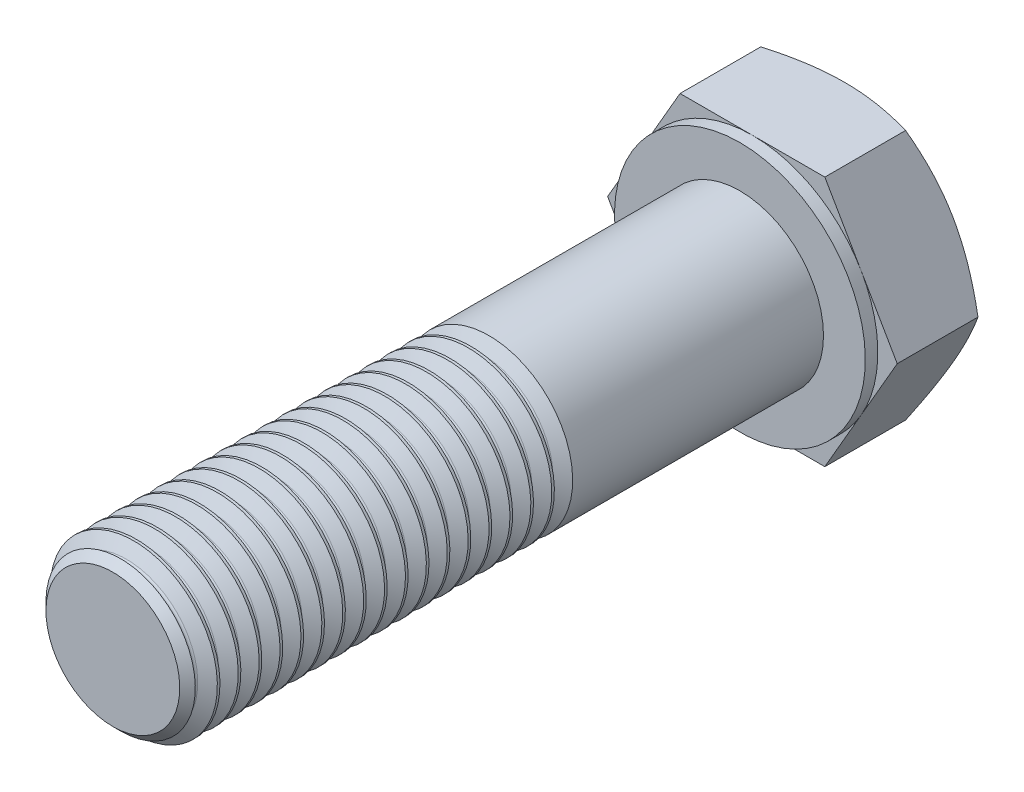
ISO-10303-21;
HEADER;
FILE_DESCRIPTION(('STEP AP214'),'2;1');
FILE_NAME('part.step','',(''),(''),'','','');
FILE_SCHEMA(('AUTOMOTIVE_DESIGN { 1 0 10303 214 1 1 1 1 }'));
ENDSEC;
DATA;
#1=APPLICATION_CONTEXT('core data for automotive mechanical design processes');
#2=APPLICATION_PROTOCOL_DEFINITION('international standard','automotive_design',2000,#1);
#3=PRODUCT_CONTEXT('',#1,'mechanical');
#4=PRODUCT('Part','Part','',(#3));
#5=PRODUCT_RELATED_PRODUCT_CATEGORY('part','',(#4));
#6=PRODUCT_DEFINITION_FORMATION('','',#4);
#7=PRODUCT_DEFINITION_CONTEXT('part definition',#1,'design');
#8=PRODUCT_DEFINITION('design','',#6,#7);
#9=PRODUCT_DEFINITION_SHAPE('','',#8);
#10=(LENGTH_UNIT() NAMED_UNIT(*) SI_UNIT(.MILLI.,.METRE.));
#11=(NAMED_UNIT(*) PLANE_ANGLE_UNIT() SI_UNIT($,.RADIAN.));
#12=(NAMED_UNIT(*) SI_UNIT($,.STERADIAN.) SOLID_ANGLE_UNIT());
#13=UNCERTAINTY_MEASURE_WITH_UNIT(LENGTH_MEASURE(1.E-05),#10,'distance_accuracy_value','');
#14=(GEOMETRIC_REPRESENTATION_CONTEXT(3) GLOBAL_UNCERTAINTY_ASSIGNED_CONTEXT((#13)) GLOBAL_UNIT_ASSIGNED_CONTEXT((#10,
#11,#12)) REPRESENTATION_CONTEXT('',''));
#15=CARTESIAN_POINT('',(0.,0.,0.));
#16=DIRECTION('',(0.,0.,1.));
#17=DIRECTION('',(1.,0.,0.));
#18=AXIS2_PLACEMENT_3D('',#15,#16,#17);
#19=CARTESIAN_POINT('',(0.,-18.,-91.8));
#20=DIRECTION('',(0.,0.,1.));
#21=DIRECTION('',(0.,-1.,0.));
#22=AXIS2_PLACEMENT_3D('',#19,#20,#21);
#23=PLANE('',#22);
#24=DIRECTION('',(-0.5,-0.866025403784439,0.));
#25=VECTOR('',#24,1.);
#26=CARTESIAN_POINT('',(-23.3826859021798,-4.49999999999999,-91.8));
#27=LINE('',#26,#25);
#28=CARTESIAN_POINT('',(-15.5884572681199,9.00000000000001,-91.8));
#29=VERTEX_POINT('',#28);
#30=CARTESIAN_POINT('',(-20.7846096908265,0.,-91.8));
#31=VERTEX_POINT('',#30);
#32=EDGE_CURVE('E533',#29,#31,#27,.T.);
#33=ORIENTED_EDGE('',*,*,#32,.T.);
#34=DIRECTION('',(0.5,-0.866025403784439,0.));
#35=VECTOR('',#34,1.);
#36=CARTESIAN_POINT('',(-7.79422863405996,-22.5,-91.8));
#37=LINE('',#36,#35);
#38=CARTESIAN_POINT('',(-15.5884572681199,-8.99999999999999,-91.8));
#39=VERTEX_POINT('',#38);
#40=EDGE_CURVE('E574',#31,#39,#37,.T.);
#41=ORIENTED_EDGE('',*,*,#40,.T.);
#42=CARTESIAN_POINT('',(0.,0.,-91.8));
#43=DIRECTION('',(0.,0.,-1.));
#44=DIRECTION('',(0.,1.,0.));
#45=AXIS2_PLACEMENT_3D('',#42,#43,#44);
#46=CIRCLE('',#45,18.);
#47=EDGE_CURVE('E569',#39,#29,#46,.T.);
#48=ORIENTED_EDGE('',*,*,#47,.T.);
#49=EDGE_LOOP('',(#33,#41,#48));
#50=FACE_BOUND('',#49,.T.);
#51=ADVANCED_FACE('F34',(#50),#23,.T.);
#52=CARTESIAN_POINT('',(0.,-18.,-91.8));
#53=VERTEX_POINT('',#52);
#54=EDGE_CURVE('E494',#53,#39,#46,.T.);
#55=ORIENTED_EDGE('',*,*,#54,.T.);
#56=CARTESIAN_POINT('',(-10.3923048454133,-18.,-91.8));
#57=VERTEX_POINT('',#56);
#58=EDGE_CURVE('E523',#39,#57,#37,.T.);
#59=ORIENTED_EDGE('',*,*,#58,.T.);
#60=DIRECTION('',(1.,0.,0.));
#61=VECTOR('',#60,1.);
#62=CARTESIAN_POINT('',(0.,-18.,-91.8));
#63=LINE('',#62,#61);
#64=EDGE_CURVE('E205',#57,#53,#63,.T.);
#65=ORIENTED_EDGE('',*,*,#64,.T.);
#66=EDGE_LOOP('',(#55,#59,#65));
#67=FACE_BOUND('',#66,.T.);
#68=ADVANCED_FACE('F553',(#67),#23,.T.);
#69=CARTESIAN_POINT('',(15.5884572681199,-8.99999999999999,-91.8));
#70=VERTEX_POINT('',#69);
#71=EDGE_CURVE('E204',#70,#53,#46,.T.);
#72=ORIENTED_EDGE('',*,*,#71,.T.);
#73=CARTESIAN_POINT('',(10.3923048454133,-18.,-91.8));
#74=VERTEX_POINT('',#73);
#75=EDGE_CURVE('E192',#53,#74,#63,.T.);
#76=ORIENTED_EDGE('',*,*,#75,.T.);
#77=DIRECTION('',(0.5,0.866025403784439,0.));
#78=VECTOR('',#77,1.);
#79=CARTESIAN_POINT('',(7.79422863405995,-22.5,-91.8));
#80=LINE('',#79,#78);
#81=EDGE_CURVE('E202',#74,#70,#80,.T.);
#82=ORIENTED_EDGE('',*,*,#81,.T.);
#83=EDGE_LOOP('',(#72,#76,#82));
#84=FACE_BOUND('',#83,.T.);
#85=ADVANCED_FACE('F201',(#84),#23,.T.);
#86=DIRECTION('',(-1.,0.,0.));
#87=VECTOR('',#86,1.);
#88=CARTESIAN_POINT('',(0.,18.,-91.8));
#89=LINE('',#88,#87);
#90=CARTESIAN_POINT('',(0.,18.,-91.8));
#91=VERTEX_POINT('',#90);
#92=CARTESIAN_POINT('',(-10.3923048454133,18.,-91.8));
#93=VERTEX_POINT('',#92);
#94=EDGE_CURVE('E146',#91,#93,#89,.T.);
#95=ORIENTED_EDGE('',*,*,#94,.T.);
#96=EDGE_CURVE('E536',#93,#29,#27,.T.);
#97=ORIENTED_EDGE('',*,*,#96,.T.);
#98=EDGE_CURVE('E225',#29,#91,#46,.T.);
#99=ORIENTED_EDGE('',*,*,#98,.T.);
#100=EDGE_LOOP('',(#95,#97,#99));
#101=FACE_BOUND('',#100,.T.);
#102=ADVANCED_FACE('F565',(#101),#23,.T.);
#103=CARTESIAN_POINT('',(15.5884572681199,9.00000000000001,-91.8));
#104=VERTEX_POINT('',#103);
#105=EDGE_CURVE('E232',#104,#70,#46,.T.);
#106=ORIENTED_EDGE('',*,*,#105,.T.);
#107=CARTESIAN_POINT('',(20.7846096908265,0.,-91.8));
#108=VERTEX_POINT('',#107);
#109=EDGE_CURVE('E221',#70,#108,#80,.T.);
#110=ORIENTED_EDGE('',*,*,#109,.T.);
#111=DIRECTION('',(-0.5,0.866025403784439,0.));
#112=VECTOR('',#111,1.);
#113=CARTESIAN_POINT('',(23.3826859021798,-4.49999999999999,-91.8));
#114=LINE('',#113,#112);
#115=EDGE_CURVE('E144',#108,#104,#114,.T.);
#116=ORIENTED_EDGE('',*,*,#115,.T.);
#117=EDGE_LOOP('',(#106,#110,#116));
#118=FACE_BOUND('',#117,.T.);
#119=ADVANCED_FACE('F496',(#118),#23,.T.);
#120=CARTESIAN_POINT('',(10.3923048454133,18.,-91.8));
#121=VERTEX_POINT('',#120);
#122=EDGE_CURVE('E129',#104,#121,#114,.T.);
#123=ORIENTED_EDGE('',*,*,#122,.T.);
#124=EDGE_CURVE('E136',#121,#91,#89,.T.);
#125=ORIENTED_EDGE('',*,*,#124,.T.);
#126=EDGE_CURVE('E228',#91,#104,#46,.T.);
#127=ORIENTED_EDGE('',*,*,#126,.T.);
#128=EDGE_LOOP('',(#123,#125,#127));
#129=FACE_BOUND('',#128,.T.);
#130=ADVANCED_FACE('F480',(#129),#23,.T.);
#131=CARTESIAN_POINT('',(0.,0.,-90.));
#132=DIRECTION('',(0.,0.,-1.));
#133=DIRECTION('',(0.,1.,0.));
#134=AXIS2_PLACEMENT_3D('',#131,#132,#133);
#135=PLANE('',#134);
#136=CARTESIAN_POINT('',(0.,0.,-90.));
#137=DIRECTION('',(0.,0.,-1.));
#138=DIRECTION('',(0.,1.,0.));
#139=AXIS2_PLACEMENT_3D('',#136,#137,#138);
#140=CIRCLE('',#139,12.);
#141=CARTESIAN_POINT('',(0.,12.,-90.));
#142=VERTEX_POINT('',#141);
#143=EDGE_CURVE('E235',#142,#142,#140,.T.);
#144=ORIENTED_EDGE('',*,*,#143,.T.);
#145=EDGE_LOOP('',(#144));
#146=FACE_BOUND('',#145,.T.);
#147=CARTESIAN_POINT('',(0.,0.,-90.));
#148=DIRECTION('',(0.,0.,-1.));
#149=DIRECTION('',(0.,1.,0.));
#150=AXIS2_PLACEMENT_3D('',#147,#148,#149);
#151=CIRCLE('',#150,18.);
#152=CARTESIAN_POINT('',(0.,18.,-90.));
#153=VERTEX_POINT('',#152);
#154=EDGE_CURVE('E231',#153,#153,#151,.T.);
#155=ORIENTED_EDGE('',*,*,#154,.F.);
#156=EDGE_LOOP('',(#155));
#157=FACE_BOUND('',#156,.T.);
#158=ADVANCED_FACE('F477',(#146,#157),#135,.F.);
#159=CARTESIAN_POINT('',(0.,0.,0.));
#160=DIRECTION('',(0.,0.,1.));
#161=DIRECTION('',(0.,-1.,0.));
#162=AXIS2_PLACEMENT_3D('',#159,#160,#161);
#163=CYLINDRICAL_SURFACE('',#162,12.);
#164=CARTESIAN_POINT('',(0.,0.,-51.));
#165=DIRECTION('',(0.,0.,1.));
#166=DIRECTION('',(0.,-1.,0.));
#167=AXIS2_PLACEMENT_3D('',#164,#165,#166);
#168=CIRCLE('',#167,12.);
#169=CARTESIAN_POINT('',(0.,-12.,-51.));
#170=VERTEX_POINT('',#169);
#171=EDGE_CURVE('E433',#170,#170,#168,.T.);
#172=ORIENTED_EDGE('',*,*,#171,.F.);
#173=EDGE_LOOP('',(#172));
#174=FACE_BOUND('',#173,.T.);
#175=CARTESIAN_POINT('',(0.,0.,-51.375));
#176=DIRECTION('',(0.,0.,1.));
#177=DIRECTION('',(0.,-1.,0.));
#178=AXIS2_PLACEMENT_3D('',#175,#176,#177);
#179=CIRCLE('',#178,12.);
#180=CARTESIAN_POINT('',(0.,-12.,-51.375));
#181=VERTEX_POINT('',#180);
#182=EDGE_CURVE('E43',#181,#181,#179,.T.);
#183=ORIENTED_EDGE('',*,*,#182,.T.);
#184=EDGE_LOOP('',(#183));
#185=FACE_BOUND('',#184,.T.);
#186=ADVANCED_FACE('F451',(#174,#185),#163,.T.);
#187=CARTESIAN_POINT('',(0.,0.,-52.40625));
#188=DIRECTION('',(0.,0.,1.));
#189=DIRECTION('',(0.,-1.,0.));
#190=AXIS2_PLACEMENT_3D('',#187,#188,#189);
#191=CONICAL_SURFACE('',#190,10.2138226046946,1.04719755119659);
#192=ORIENTED_EDGE('',*,*,#182,.F.);
#193=EDGE_LOOP('',(#192));
#194=FACE_BOUND('',#193,.T.);
#195=CARTESIAN_POINT('',(0.,0.,-52.40625));
#196=DIRECTION('',(0.,0.,1.));
#197=DIRECTION('',(0.,-1.,0.));
#198=AXIS2_PLACEMENT_3D('',#195,#196,#197);
#199=CIRCLE('',#198,10.2138226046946);
#200=CARTESIAN_POINT('',(0.,-10.2138226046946,-52.40625));
#201=VERTEX_POINT('',#200);
#202=EDGE_CURVE('E439',#201,#201,#199,.T.);
#203=ORIENTED_EDGE('',*,*,#202,.T.);
#204=EDGE_LOOP('',(#203));
#205=FACE_BOUND('',#204,.T.);
#206=ADVANCED_FACE('F453',(#194,#205),#191,.T.);
#207=CARTESIAN_POINT('',(0.,0.,-54.));
#208=DIRECTION('',(0.,0.,-1.));
#209=DIRECTION('',(0.,1.,0.));
#210=AXIS2_PLACEMENT_3D('',#207,#208,#209);
#211=CONICAL_SURFACE('',#210,12.,1.04719755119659);
#212=CARTESIAN_POINT('',(0.,0.,-52.96875));
#213=DIRECTION('',(0.,0.,1.));
#214=DIRECTION('',(0.,-1.,0.));
#215=AXIS2_PLACEMENT_3D('',#212,#213,#214);
#216=CIRCLE('',#215,10.2138226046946);
#217=CARTESIAN_POINT('',(0.,-10.2138226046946,-52.96875));
#218=VERTEX_POINT('',#217);
#219=EDGE_CURVE('E442',#218,#218,#216,.T.);
#220=ORIENTED_EDGE('',*,*,#219,.F.);
#221=EDGE_LOOP('',(#220));
#222=FACE_BOUND('',#221,.T.);
#223=CARTESIAN_POINT('',(0.,0.,-54.));
#224=DIRECTION('',(0.,0.,1.));
#225=DIRECTION('',(0.,-1.,0.));
#226=AXIS2_PLACEMENT_3D('',#223,#224,#225);
#227=CIRCLE('',#226,12.);
#228=CARTESIAN_POINT('',(0.,-12.,-54.));
#229=VERTEX_POINT('',#228);
#230=EDGE_CURVE('E445',#229,#229,#227,.T.);
#231=ORIENTED_EDGE('',*,*,#230,.T.);
#232=EDGE_LOOP('',(#231));
#233=FACE_BOUND('',#232,.T.);
#234=ADVANCED_FACE('F456',(#222,#233),#211,.T.);
#235=CARTESIAN_POINT('',(0.,0.,-52.6875));
#236=DIRECTION('',(0.,0.,1.));
#237=DIRECTION('',(0.,-1.,0.));
#238=AXIS2_PLACEMENT_3D('',#235,#236,#237);
#239=TOROIDAL_SURFACE('',#238,10.3762023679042,0.324759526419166);
#240=ORIENTED_EDGE('',*,*,#202,.F.);
#241=EDGE_LOOP('',(#240));
#242=FACE_BOUND('',#241,.T.);
#243=ORIENTED_EDGE('',*,*,#219,.T.);
#244=EDGE_LOOP('',(#243));
#245=FACE_BOUND('',#244,.T.);
#246=ADVANCED_FACE('F460',(#242,#245),#239,.F.);
#247=ORIENTED_EDGE('',*,*,#230,.F.);
#248=EDGE_LOOP('',(#247));
#249=FACE_BOUND('',#248,.T.);
#250=ORIENTED_EDGE('',*,*,#143,.F.);
#251=EDGE_LOOP('',(#250));
#252=FACE_BOUND('',#251,.T.);
#253=ADVANCED_FACE('F36',(#249,#252),#163,.T.);
#254=CARTESIAN_POINT('',(0.,0.,-49.40625));
#255=DIRECTION('',(0.,0.,1.));
#256=DIRECTION('',(0.,-1.,0.));
#257=AXIS2_PLACEMENT_3D('',#254,#255,#256);
#258=CONICAL_SURFACE('',#257,10.2138226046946,1.04719755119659);
#259=CARTESIAN_POINT('',(0.,0.,-48.375));
#260=DIRECTION('',(0.,0.,1.));
#261=DIRECTION('',(0.,-1.,0.));
#262=AXIS2_PLACEMENT_3D('',#259,#260,#261);
#263=CIRCLE('',#262,12.);
#264=CARTESIAN_POINT('',(0.,-12.,-48.375));
#265=VERTEX_POINT('',#264);
#266=EDGE_CURVE('E436',#265,#265,#263,.T.);
#267=ORIENTED_EDGE('',*,*,#266,.F.);
#268=EDGE_LOOP('',(#267));
#269=FACE_BOUND('',#268,.T.);
#270=CARTESIAN_POINT('',(0.,0.,-49.40625));
#271=DIRECTION('',(0.,0.,1.));
#272=DIRECTION('',(0.,-1.,0.));
#273=AXIS2_PLACEMENT_3D('',#270,#271,#272);
#274=CIRCLE('',#273,10.2138226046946);
#275=CARTESIAN_POINT('',(0.,-10.2138226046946,-49.40625));
#276=VERTEX_POINT('',#275);
#277=EDGE_CURVE('E427',#276,#276,#274,.T.);
#278=ORIENTED_EDGE('',*,*,#277,.T.);
#279=EDGE_LOOP('',(#278));
#280=FACE_BOUND('',#279,.T.);
#281=ADVANCED_FACE('F473',(#269,#280),#258,.T.);
#282=CARTESIAN_POINT('',(0.,0.,-51.));
#283=DIRECTION('',(0.,0.,-1.));
#284=DIRECTION('',(0.,1.,0.));
#285=AXIS2_PLACEMENT_3D('',#282,#283,#284);
#286=CONICAL_SURFACE('',#285,12.,1.04719755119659);
#287=CARTESIAN_POINT('',(0.,0.,-49.96875));
#288=DIRECTION('',(0.,0.,1.));
#289=DIRECTION('',(0.,-1.,0.));
#290=AXIS2_PLACEMENT_3D('',#287,#288,#289);
#291=CIRCLE('',#290,10.2138226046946);
#292=CARTESIAN_POINT('',(0.,-10.2138226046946,-49.96875));
#293=VERTEX_POINT('',#292);
#294=EDGE_CURVE('E430',#293,#293,#291,.T.);
#295=ORIENTED_EDGE('',*,*,#294,.F.);
#296=EDGE_LOOP('',(#295));
#297=FACE_BOUND('',#296,.T.);
#298=ORIENTED_EDGE('',*,*,#171,.T.);
#299=EDGE_LOOP('',(#298));
#300=FACE_BOUND('',#299,.T.);
#301=ADVANCED_FACE('F1351',(#297,#300),#286,.T.);
#302=CARTESIAN_POINT('',(0.,0.,-49.6875));
#303=DIRECTION('',(0.,0.,1.));
#304=DIRECTION('',(0.,-1.,0.));
#305=AXIS2_PLACEMENT_3D('',#302,#303,#304);
#306=TOROIDAL_SURFACE('',#305,10.3762023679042,0.324759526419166);
#307=ORIENTED_EDGE('',*,*,#277,.F.);
#308=EDGE_LOOP('',(#307));
#309=FACE_BOUND('',#308,.T.);
#310=ORIENTED_EDGE('',*,*,#294,.T.);
#311=EDGE_LOOP('',(#310));
#312=FACE_BOUND('',#311,.T.);
#313=ADVANCED_FACE('F1342',(#309,#312),#306,.F.);
#314=CARTESIAN_POINT('',(0.,0.,-48.));
#315=DIRECTION('',(0.,0.,1.));
#316=DIRECTION('',(0.,-1.,0.));
#317=AXIS2_PLACEMENT_3D('',#314,#315,#316);
#318=CIRCLE('',#317,12.);
#319=CARTESIAN_POINT('',(0.,-12.,-48.));
#320=VERTEX_POINT('',#319);
#321=EDGE_CURVE('E421',#320,#320,#318,.T.);
#322=ORIENTED_EDGE('',*,*,#321,.F.);
#323=EDGE_LOOP('',(#322));
#324=FACE_BOUND('',#323,.T.);
#325=ORIENTED_EDGE('',*,*,#266,.T.);
#326=EDGE_LOOP('',(#325));
#327=FACE_BOUND('',#326,.T.);
#328=ADVANCED_FACE('F1305',(#324,#327),#163,.T.);
#329=CARTESIAN_POINT('',(0.,0.,-46.40625));
#330=DIRECTION('',(0.,0.,1.));
#331=DIRECTION('',(0.,-1.,0.));
#332=AXIS2_PLACEMENT_3D('',#329,#330,#331);
#333=CONICAL_SURFACE('',#332,10.2138226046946,1.04719755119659);
#334=CARTESIAN_POINT('',(0.,0.,-45.375));
#335=DIRECTION('',(0.,0.,1.));
#336=DIRECTION('',(0.,-1.,0.));
#337=AXIS2_PLACEMENT_3D('',#334,#335,#336);
#338=CIRCLE('',#337,12.);
#339=CARTESIAN_POINT('',(0.,-12.,-45.375));
#340=VERTEX_POINT('',#339);
#341=EDGE_CURVE('E424',#340,#340,#338,.T.);
#342=ORIENTED_EDGE('',*,*,#341,.F.);
#343=EDGE_LOOP('',(#342));
#344=FACE_BOUND('',#343,.T.);
#345=CARTESIAN_POINT('',(0.,0.,-46.40625));
#346=DIRECTION('',(0.,0.,1.));
#347=DIRECTION('',(0.,-1.,0.));
#348=AXIS2_PLACEMENT_3D('',#345,#346,#347);
#349=CIRCLE('',#348,10.2138226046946);
#350=CARTESIAN_POINT('',(0.,-10.2138226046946,-46.40625));
#351=VERTEX_POINT('',#350);
#352=EDGE_CURVE('E415',#351,#351,#349,.T.);
#353=ORIENTED_EDGE('',*,*,#352,.T.);
#354=EDGE_LOOP('',(#353));
#355=FACE_BOUND('',#354,.T.);
#356=ADVANCED_FACE('F1323',(#344,#355),#333,.T.);
#357=CARTESIAN_POINT('',(0.,0.,-48.));
#358=DIRECTION('',(0.,0.,-1.));
#359=DIRECTION('',(0.,1.,0.));
#360=AXIS2_PLACEMENT_3D('',#357,#358,#359);
#361=CONICAL_SURFACE('',#360,12.,1.04719755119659);
#362=CARTESIAN_POINT('',(0.,0.,-46.96875));
#363=DIRECTION('',(0.,0.,1.));
#364=DIRECTION('',(0.,-1.,0.));
#365=AXIS2_PLACEMENT_3D('',#362,#363,#364);
#366=CIRCLE('',#365,10.2138226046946);
#367=CARTESIAN_POINT('',(0.,-10.2138226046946,-46.96875));
#368=VERTEX_POINT('',#367);
#369=EDGE_CURVE('E418',#368,#368,#366,.T.);
#370=ORIENTED_EDGE('',*,*,#369,.F.);
#371=EDGE_LOOP('',(#370));
#372=FACE_BOUND('',#371,.T.);
#373=ORIENTED_EDGE('',*,*,#321,.T.);
#374=EDGE_LOOP('',(#373));
#375=FACE_BOUND('',#374,.T.);
#376=ADVANCED_FACE('F1313',(#372,#375),#361,.T.);
#377=CARTESIAN_POINT('',(0.,0.,-46.6875));
#378=DIRECTION('',(0.,0.,1.));
#379=DIRECTION('',(0.,-1.,0.));
#380=AXIS2_PLACEMENT_3D('',#377,#378,#379);
#381=TOROIDAL_SURFACE('',#380,10.3762023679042,0.324759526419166);
#382=ORIENTED_EDGE('',*,*,#352,.F.);
#383=EDGE_LOOP('',(#382));
#384=FACE_BOUND('',#383,.T.);
#385=ORIENTED_EDGE('',*,*,#369,.T.);
#386=EDGE_LOOP('',(#385));
#387=FACE_BOUND('',#386,.T.);
#388=ADVANCED_FACE('F1303',(#384,#387),#381,.F.);
#389=CARTESIAN_POINT('',(0.,0.,-45.));
#390=DIRECTION('',(0.,0.,1.));
#391=DIRECTION('',(0.,-1.,0.));
#392=AXIS2_PLACEMENT_3D('',#389,#390,#391);
#393=CIRCLE('',#392,12.);
#394=CARTESIAN_POINT('',(0.,-12.,-45.));
#395=VERTEX_POINT('',#394);
#396=EDGE_CURVE('E409',#395,#395,#393,.T.);
#397=ORIENTED_EDGE('',*,*,#396,.F.);
#398=EDGE_LOOP('',(#397));
#399=FACE_BOUND('',#398,.T.);
#400=ORIENTED_EDGE('',*,*,#341,.T.);
#401=EDGE_LOOP('',(#400));
#402=FACE_BOUND('',#401,.T.);
#403=ADVANCED_FACE('F1266',(#399,#402),#163,.T.);
#404=CARTESIAN_POINT('',(0.,0.,-43.40625));
#405=DIRECTION('',(0.,0.,1.));
#406=DIRECTION('',(0.,-1.,0.));
#407=AXIS2_PLACEMENT_3D('',#404,#405,#406);
#408=CONICAL_SURFACE('',#407,10.2138226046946,1.04719755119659);
#409=CARTESIAN_POINT('',(0.,0.,-42.375));
#410=DIRECTION('',(0.,0.,1.));
#411=DIRECTION('',(0.,-1.,0.));
#412=AXIS2_PLACEMENT_3D('',#409,#410,#411);
#413=CIRCLE('',#412,12.);
#414=CARTESIAN_POINT('',(0.,-12.,-42.375));
#415=VERTEX_POINT('',#414);
#416=EDGE_CURVE('E412',#415,#415,#413,.T.);
#417=ORIENTED_EDGE('',*,*,#416,.F.);
#418=EDGE_LOOP('',(#417));
#419=FACE_BOUND('',#418,.T.);
#420=CARTESIAN_POINT('',(0.,0.,-43.40625));
#421=DIRECTION('',(0.,0.,1.));
#422=DIRECTION('',(0.,-1.,0.));
#423=AXIS2_PLACEMENT_3D('',#420,#421,#422);
#424=CIRCLE('',#423,10.2138226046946);
#425=CARTESIAN_POINT('',(0.,-10.2138226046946,-43.40625));
#426=VERTEX_POINT('',#425);
#427=EDGE_CURVE('E403',#426,#426,#424,.T.);
#428=ORIENTED_EDGE('',*,*,#427,.T.);
#429=EDGE_LOOP('',(#428));
#430=FACE_BOUND('',#429,.T.);
#431=ADVANCED_FACE('F1284',(#419,#430),#408,.T.);
#432=CARTESIAN_POINT('',(0.,0.,-45.));
#433=DIRECTION('',(0.,0.,-1.));
#434=DIRECTION('',(0.,1.,0.));
#435=AXIS2_PLACEMENT_3D('',#432,#433,#434);
#436=CONICAL_SURFACE('',#435,12.,1.04719755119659);
#437=CARTESIAN_POINT('',(0.,0.,-43.96875));
#438=DIRECTION('',(0.,0.,1.));
#439=DIRECTION('',(0.,-1.,0.));
#440=AXIS2_PLACEMENT_3D('',#437,#438,#439);
#441=CIRCLE('',#440,10.2138226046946);
#442=CARTESIAN_POINT('',(0.,-10.2138226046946,-43.96875));
#443=VERTEX_POINT('',#442);
#444=EDGE_CURVE('E406',#443,#443,#441,.T.);
#445=ORIENTED_EDGE('',*,*,#444,.F.);
#446=EDGE_LOOP('',(#445));
#447=FACE_BOUND('',#446,.T.);
#448=ORIENTED_EDGE('',*,*,#396,.T.);
#449=EDGE_LOOP('',(#448));
#450=FACE_BOUND('',#449,.T.);
#451=ADVANCED_FACE('F1274',(#447,#450),#436,.T.);
#452=CARTESIAN_POINT('',(0.,0.,-43.6875));
#453=DIRECTION('',(0.,0.,1.));
#454=DIRECTION('',(0.,-1.,0.));
#455=AXIS2_PLACEMENT_3D('',#452,#453,#454);
#456=TOROIDAL_SURFACE('',#455,10.3762023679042,0.324759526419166);
#457=ORIENTED_EDGE('',*,*,#427,.F.);
#458=EDGE_LOOP('',(#457));
#459=FACE_BOUND('',#458,.T.);
#460=ORIENTED_EDGE('',*,*,#444,.T.);
#461=EDGE_LOOP('',(#460));
#462=FACE_BOUND('',#461,.T.);
#463=ADVANCED_FACE('F1264',(#459,#462),#456,.F.);
#464=CARTESIAN_POINT('',(0.,0.,-42.));
#465=DIRECTION('',(0.,0.,1.));
#466=DIRECTION('',(0.,-1.,0.));
#467=AXIS2_PLACEMENT_3D('',#464,#465,#466);
#468=CIRCLE('',#467,12.);
#469=CARTESIAN_POINT('',(0.,-12.,-42.));
#470=VERTEX_POINT('',#469);
#471=EDGE_CURVE('E397',#470,#470,#468,.T.);
#472=ORIENTED_EDGE('',*,*,#471,.F.);
#473=EDGE_LOOP('',(#472));
#474=FACE_BOUND('',#473,.T.);
#475=ORIENTED_EDGE('',*,*,#416,.T.);
#476=EDGE_LOOP('',(#475));
#477=FACE_BOUND('',#476,.T.);
#478=ADVANCED_FACE('F1227',(#474,#477),#163,.T.);
#479=CARTESIAN_POINT('',(0.,0.,-40.40625));
#480=DIRECTION('',(0.,0.,1.));
#481=DIRECTION('',(0.,-1.,0.));
#482=AXIS2_PLACEMENT_3D('',#479,#480,#481);
#483=CONICAL_SURFACE('',#482,10.2138226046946,1.04719755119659);
#484=CARTESIAN_POINT('',(0.,0.,-39.375));
#485=DIRECTION('',(0.,0.,1.));
#486=DIRECTION('',(0.,-1.,0.));
#487=AXIS2_PLACEMENT_3D('',#484,#485,#486);
#488=CIRCLE('',#487,12.);
#489=CARTESIAN_POINT('',(0.,-12.,-39.375));
#490=VERTEX_POINT('',#489);
#491=EDGE_CURVE('E400',#490,#490,#488,.T.);
#492=ORIENTED_EDGE('',*,*,#491,.F.);
#493=EDGE_LOOP('',(#492));
#494=FACE_BOUND('',#493,.T.);
#495=CARTESIAN_POINT('',(0.,0.,-40.40625));
#496=DIRECTION('',(0.,0.,1.));
#497=DIRECTION('',(0.,-1.,0.));
#498=AXIS2_PLACEMENT_3D('',#495,#496,#497);
#499=CIRCLE('',#498,10.2138226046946);
#500=CARTESIAN_POINT('',(0.,-10.2138226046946,-40.40625));
#501=VERTEX_POINT('',#500);
#502=EDGE_CURVE('E391',#501,#501,#499,.T.);
#503=ORIENTED_EDGE('',*,*,#502,.T.);
#504=EDGE_LOOP('',(#503));
#505=FACE_BOUND('',#504,.T.);
#506=ADVANCED_FACE('F1245',(#494,#505),#483,.T.);
#507=CARTESIAN_POINT('',(0.,0.,-42.));
#508=DIRECTION('',(0.,0.,-1.));
#509=DIRECTION('',(0.,1.,0.));
#510=AXIS2_PLACEMENT_3D('',#507,#508,#509);
#511=CONICAL_SURFACE('',#510,12.,1.04719755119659);
#512=CARTESIAN_POINT('',(0.,0.,-40.96875));
#513=DIRECTION('',(0.,0.,1.));
#514=DIRECTION('',(0.,-1.,0.));
#515=AXIS2_PLACEMENT_3D('',#512,#513,#514);
#516=CIRCLE('',#515,10.2138226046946);
#517=CARTESIAN_POINT('',(0.,-10.2138226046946,-40.96875));
#518=VERTEX_POINT('',#517);
#519=EDGE_CURVE('E394',#518,#518,#516,.T.);
#520=ORIENTED_EDGE('',*,*,#519,.F.);
#521=EDGE_LOOP('',(#520));
#522=FACE_BOUND('',#521,.T.);
#523=ORIENTED_EDGE('',*,*,#471,.T.);
#524=EDGE_LOOP('',(#523));
#525=FACE_BOUND('',#524,.T.);
#526=ADVANCED_FACE('F1235',(#522,#525),#511,.T.);
#527=CARTESIAN_POINT('',(0.,0.,-40.6875));
#528=DIRECTION('',(0.,0.,1.));
#529=DIRECTION('',(0.,-1.,0.));
#530=AXIS2_PLACEMENT_3D('',#527,#528,#529);
#531=TOROIDAL_SURFACE('',#530,10.3762023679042,0.324759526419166);
#532=ORIENTED_EDGE('',*,*,#502,.F.);
#533=EDGE_LOOP('',(#532));
#534=FACE_BOUND('',#533,.T.);
#535=ORIENTED_EDGE('',*,*,#519,.T.);
#536=EDGE_LOOP('',(#535));
#537=FACE_BOUND('',#536,.T.);
#538=ADVANCED_FACE('F1225',(#534,#537),#531,.F.);
#539=CARTESIAN_POINT('',(0.,0.,-39.));
#540=DIRECTION('',(0.,0.,1.));
#541=DIRECTION('',(0.,-1.,0.));
#542=AXIS2_PLACEMENT_3D('',#539,#540,#541);
#543=CIRCLE('',#542,12.);
#544=CARTESIAN_POINT('',(0.,-12.,-39.));
#545=VERTEX_POINT('',#544);
#546=EDGE_CURVE('E385',#545,#545,#543,.T.);
#547=ORIENTED_EDGE('',*,*,#546,.F.);
#548=EDGE_LOOP('',(#547));
#549=FACE_BOUND('',#548,.T.);
#550=ORIENTED_EDGE('',*,*,#491,.T.);
#551=EDGE_LOOP('',(#550));
#552=FACE_BOUND('',#551,.T.);
#553=ADVANCED_FACE('F1188',(#549,#552),#163,.T.);
#554=CARTESIAN_POINT('',(0.,0.,-37.40625));
#555=DIRECTION('',(0.,0.,1.));
#556=DIRECTION('',(0.,-1.,0.));
#557=AXIS2_PLACEMENT_3D('',#554,#555,#556);
#558=CONICAL_SURFACE('',#557,10.2138226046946,1.04719755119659);
#559=CARTESIAN_POINT('',(0.,0.,-36.375));
#560=DIRECTION('',(0.,0.,1.));
#561=DIRECTION('',(0.,-1.,0.));
#562=AXIS2_PLACEMENT_3D('',#559,#560,#561);
#563=CIRCLE('',#562,12.);
#564=CARTESIAN_POINT('',(0.,-12.,-36.375));
#565=VERTEX_POINT('',#564);
#566=EDGE_CURVE('E388',#565,#565,#563,.T.);
#567=ORIENTED_EDGE('',*,*,#566,.F.);
#568=EDGE_LOOP('',(#567));
#569=FACE_BOUND('',#568,.T.);
#570=CARTESIAN_POINT('',(0.,0.,-37.40625));
#571=DIRECTION('',(0.,0.,1.));
#572=DIRECTION('',(0.,-1.,0.));
#573=AXIS2_PLACEMENT_3D('',#570,#571,#572);
#574=CIRCLE('',#573,10.2138226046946);
#575=CARTESIAN_POINT('',(0.,-10.2138226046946,-37.40625));
#576=VERTEX_POINT('',#575);
#577=EDGE_CURVE('E379',#576,#576,#574,.T.);
#578=ORIENTED_EDGE('',*,*,#577,.T.);
#579=EDGE_LOOP('',(#578));
#580=FACE_BOUND('',#579,.T.);
#581=ADVANCED_FACE('F1206',(#569,#580),#558,.T.);
#582=CARTESIAN_POINT('',(0.,0.,-39.));
#583=DIRECTION('',(0.,0.,-1.));
#584=DIRECTION('',(0.,1.,0.));
#585=AXIS2_PLACEMENT_3D('',#582,#583,#584);
#586=CONICAL_SURFACE('',#585,12.,1.04719755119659);
#587=CARTESIAN_POINT('',(0.,0.,-37.96875));
#588=DIRECTION('',(0.,0.,1.));
#589=DIRECTION('',(0.,-1.,0.));
#590=AXIS2_PLACEMENT_3D('',#587,#588,#589);
#591=CIRCLE('',#590,10.2138226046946);
#592=CARTESIAN_POINT('',(0.,-10.2138226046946,-37.96875));
#593=VERTEX_POINT('',#592);
#594=EDGE_CURVE('E382',#593,#593,#591,.T.);
#595=ORIENTED_EDGE('',*,*,#594,.F.);
#596=EDGE_LOOP('',(#595));
#597=FACE_BOUND('',#596,.T.);
#598=ORIENTED_EDGE('',*,*,#546,.T.);
#599=EDGE_LOOP('',(#598));
#600=FACE_BOUND('',#599,.T.);
#601=ADVANCED_FACE('F1196',(#597,#600),#586,.T.);
#602=CARTESIAN_POINT('',(0.,0.,-37.6875));
#603=DIRECTION('',(0.,0.,1.));
#604=DIRECTION('',(0.,-1.,0.));
#605=AXIS2_PLACEMENT_3D('',#602,#603,#604);
#606=TOROIDAL_SURFACE('',#605,10.3762023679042,0.324759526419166);
#607=ORIENTED_EDGE('',*,*,#577,.F.);
#608=EDGE_LOOP('',(#607));
#609=FACE_BOUND('',#608,.T.);
#610=ORIENTED_EDGE('',*,*,#594,.T.);
#611=EDGE_LOOP('',(#610));
#612=FACE_BOUND('',#611,.T.);
#613=ADVANCED_FACE('F1186',(#609,#612),#606,.F.);
#614=CARTESIAN_POINT('',(0.,0.,-36.));
#615=DIRECTION('',(0.,0.,1.));
#616=DIRECTION('',(0.,-1.,0.));
#617=AXIS2_PLACEMENT_3D('',#614,#615,#616);
#618=CIRCLE('',#617,12.);
#619=CARTESIAN_POINT('',(0.,-12.,-36.));
#620=VERTEX_POINT('',#619);
#621=EDGE_CURVE('E373',#620,#620,#618,.T.);
#622=ORIENTED_EDGE('',*,*,#621,.F.);
#623=EDGE_LOOP('',(#622));
#624=FACE_BOUND('',#623,.T.);
#625=ORIENTED_EDGE('',*,*,#566,.T.);
#626=EDGE_LOOP('',(#625));
#627=FACE_BOUND('',#626,.T.);
#628=ADVANCED_FACE('F1149',(#624,#627),#163,.T.);
#629=CARTESIAN_POINT('',(0.,0.,-34.40625));
#630=DIRECTION('',(0.,0.,1.));
#631=DIRECTION('',(0.,-1.,0.));
#632=AXIS2_PLACEMENT_3D('',#629,#630,#631);
#633=CONICAL_SURFACE('',#632,10.2138226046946,1.04719755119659);
#634=CARTESIAN_POINT('',(0.,0.,-33.375));
#635=DIRECTION('',(0.,0.,1.));
#636=DIRECTION('',(0.,-1.,0.));
#637=AXIS2_PLACEMENT_3D('',#634,#635,#636);
#638=CIRCLE('',#637,12.);
#639=CARTESIAN_POINT('',(0.,-12.,-33.375));
#640=VERTEX_POINT('',#639);
#641=EDGE_CURVE('E376',#640,#640,#638,.T.);
#642=ORIENTED_EDGE('',*,*,#641,.F.);
#643=EDGE_LOOP('',(#642));
#644=FACE_BOUND('',#643,.T.);
#645=CARTESIAN_POINT('',(0.,0.,-34.40625));
#646=DIRECTION('',(0.,0.,1.));
#647=DIRECTION('',(0.,-1.,0.));
#648=AXIS2_PLACEMENT_3D('',#645,#646,#647);
#649=CIRCLE('',#648,10.2138226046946);
#650=CARTESIAN_POINT('',(0.,-10.2138226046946,-34.40625));
#651=VERTEX_POINT('',#650);
#652=EDGE_CURVE('E367',#651,#651,#649,.T.);
#653=ORIENTED_EDGE('',*,*,#652,.T.);
#654=EDGE_LOOP('',(#653));
#655=FACE_BOUND('',#654,.T.);
#656=ADVANCED_FACE('F1167',(#644,#655),#633,.T.);
#657=CARTESIAN_POINT('',(0.,0.,-36.));
#658=DIRECTION('',(0.,0.,-1.));
#659=DIRECTION('',(0.,1.,0.));
#660=AXIS2_PLACEMENT_3D('',#657,#658,#659);
#661=CONICAL_SURFACE('',#660,12.,1.04719755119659);
#662=CARTESIAN_POINT('',(0.,0.,-34.96875));
#663=DIRECTION('',(0.,0.,1.));
#664=DIRECTION('',(0.,-1.,0.));
#665=AXIS2_PLACEMENT_3D('',#662,#663,#664);
#666=CIRCLE('',#665,10.2138226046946);
#667=CARTESIAN_POINT('',(0.,-10.2138226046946,-34.96875));
#668=VERTEX_POINT('',#667);
#669=EDGE_CURVE('E370',#668,#668,#666,.T.);
#670=ORIENTED_EDGE('',*,*,#669,.F.);
#671=EDGE_LOOP('',(#670));
#672=FACE_BOUND('',#671,.T.);
#673=ORIENTED_EDGE('',*,*,#621,.T.);
#674=EDGE_LOOP('',(#673));
#675=FACE_BOUND('',#674,.T.);
#676=ADVANCED_FACE('F1157',(#672,#675),#661,.T.);
#677=CARTESIAN_POINT('',(0.,0.,-34.6875));
#678=DIRECTION('',(0.,0.,1.));
#679=DIRECTION('',(0.,-1.,0.));
#680=AXIS2_PLACEMENT_3D('',#677,#678,#679);
#681=TOROIDAL_SURFACE('',#680,10.3762023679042,0.324759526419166);
#682=ORIENTED_EDGE('',*,*,#652,.F.);
#683=EDGE_LOOP('',(#682));
#684=FACE_BOUND('',#683,.T.);
#685=ORIENTED_EDGE('',*,*,#669,.T.);
#686=EDGE_LOOP('',(#685));
#687=FACE_BOUND('',#686,.T.);
#688=ADVANCED_FACE('F1147',(#684,#687),#681,.F.);
#689=CARTESIAN_POINT('',(0.,0.,-33.));
#690=DIRECTION('',(0.,0.,1.));
#691=DIRECTION('',(0.,-1.,0.));
#692=AXIS2_PLACEMENT_3D('',#689,#690,#691);
#693=CIRCLE('',#692,12.);
#694=CARTESIAN_POINT('',(0.,-12.,-33.));
#695=VERTEX_POINT('',#694);
#696=EDGE_CURVE('E361',#695,#695,#693,.T.);
#697=ORIENTED_EDGE('',*,*,#696,.F.);
#698=EDGE_LOOP('',(#697));
#699=FACE_BOUND('',#698,.T.);
#700=ORIENTED_EDGE('',*,*,#641,.T.);
#701=EDGE_LOOP('',(#700));
#702=FACE_BOUND('',#701,.T.);
#703=ADVANCED_FACE('F1110',(#699,#702),#163,.T.);
#704=CARTESIAN_POINT('',(0.,0.,-31.40625));
#705=DIRECTION('',(0.,0.,1.));
#706=DIRECTION('',(0.,-1.,0.));
#707=AXIS2_PLACEMENT_3D('',#704,#705,#706);
#708=CONICAL_SURFACE('',#707,10.2138226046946,1.04719755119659);
#709=CARTESIAN_POINT('',(0.,0.,-30.375));
#710=DIRECTION('',(0.,0.,1.));
#711=DIRECTION('',(0.,-1.,0.));
#712=AXIS2_PLACEMENT_3D('',#709,#710,#711);
#713=CIRCLE('',#712,12.);
#714=CARTESIAN_POINT('',(0.,-12.,-30.375));
#715=VERTEX_POINT('',#714);
#716=EDGE_CURVE('E364',#715,#715,#713,.T.);
#717=ORIENTED_EDGE('',*,*,#716,.F.);
#718=EDGE_LOOP('',(#717));
#719=FACE_BOUND('',#718,.T.);
#720=CARTESIAN_POINT('',(0.,0.,-31.40625));
#721=DIRECTION('',(0.,0.,1.));
#722=DIRECTION('',(0.,-1.,0.));
#723=AXIS2_PLACEMENT_3D('',#720,#721,#722);
#724=CIRCLE('',#723,10.2138226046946);
#725=CARTESIAN_POINT('',(0.,-10.2138226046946,-31.40625));
#726=VERTEX_POINT('',#725);
#727=EDGE_CURVE('E355',#726,#726,#724,.T.);
#728=ORIENTED_EDGE('',*,*,#727,.T.);
#729=EDGE_LOOP('',(#728));
#730=FACE_BOUND('',#729,.T.);
#731=ADVANCED_FACE('F1128',(#719,#730),#708,.T.);
#732=CARTESIAN_POINT('',(0.,0.,-33.));
#733=DIRECTION('',(0.,0.,-1.));
#734=DIRECTION('',(0.,1.,0.));
#735=AXIS2_PLACEMENT_3D('',#732,#733,#734);
#736=CONICAL_SURFACE('',#735,12.,1.04719755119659);
#737=CARTESIAN_POINT('',(0.,0.,-31.96875));
#738=DIRECTION('',(0.,0.,1.));
#739=DIRECTION('',(0.,-1.,0.));
#740=AXIS2_PLACEMENT_3D('',#737,#738,#739);
#741=CIRCLE('',#740,10.2138226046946);
#742=CARTESIAN_POINT('',(0.,-10.2138226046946,-31.96875));
#743=VERTEX_POINT('',#742);
#744=EDGE_CURVE('E358',#743,#743,#741,.T.);
#745=ORIENTED_EDGE('',*,*,#744,.F.);
#746=EDGE_LOOP('',(#745));
#747=FACE_BOUND('',#746,.T.);
#748=ORIENTED_EDGE('',*,*,#696,.T.);
#749=EDGE_LOOP('',(#748));
#750=FACE_BOUND('',#749,.T.);
#751=ADVANCED_FACE('F1118',(#747,#750),#736,.T.);
#752=CARTESIAN_POINT('',(0.,0.,-31.6875));
#753=DIRECTION('',(0.,0.,1.));
#754=DIRECTION('',(0.,-1.,0.));
#755=AXIS2_PLACEMENT_3D('',#752,#753,#754);
#756=TOROIDAL_SURFACE('',#755,10.3762023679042,0.324759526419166);
#757=ORIENTED_EDGE('',*,*,#727,.F.);
#758=EDGE_LOOP('',(#757));
#759=FACE_BOUND('',#758,.T.);
#760=ORIENTED_EDGE('',*,*,#744,.T.);
#761=EDGE_LOOP('',(#760));
#762=FACE_BOUND('',#761,.T.);
#763=ADVANCED_FACE('F1108',(#759,#762),#756,.F.);
#764=CARTESIAN_POINT('',(0.,0.,-30.));
#765=DIRECTION('',(0.,0.,1.));
#766=DIRECTION('',(0.,-1.,0.));
#767=AXIS2_PLACEMENT_3D('',#764,#765,#766);
#768=CIRCLE('',#767,12.);
#769=CARTESIAN_POINT('',(0.,-12.,-30.));
#770=VERTEX_POINT('',#769);
#771=EDGE_CURVE('E349',#770,#770,#768,.T.);
#772=ORIENTED_EDGE('',*,*,#771,.F.);
#773=EDGE_LOOP('',(#772));
#774=FACE_BOUND('',#773,.T.);
#775=ORIENTED_EDGE('',*,*,#716,.T.);
#776=EDGE_LOOP('',(#775));
#777=FACE_BOUND('',#776,.T.);
#778=ADVANCED_FACE('F1071',(#774,#777),#163,.T.);
#779=CARTESIAN_POINT('',(0.,0.,-28.40625));
#780=DIRECTION('',(0.,0.,1.));
#781=DIRECTION('',(0.,-1.,0.));
#782=AXIS2_PLACEMENT_3D('',#779,#780,#781);
#783=CONICAL_SURFACE('',#782,10.2138226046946,1.04719755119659);
#784=CARTESIAN_POINT('',(0.,0.,-27.375));
#785=DIRECTION('',(0.,0.,1.));
#786=DIRECTION('',(0.,-1.,0.));
#787=AXIS2_PLACEMENT_3D('',#784,#785,#786);
#788=CIRCLE('',#787,12.);
#789=CARTESIAN_POINT('',(0.,-12.,-27.375));
#790=VERTEX_POINT('',#789);
#791=EDGE_CURVE('E352',#790,#790,#788,.T.);
#792=ORIENTED_EDGE('',*,*,#791,.F.);
#793=EDGE_LOOP('',(#792));
#794=FACE_BOUND('',#793,.T.);
#795=CARTESIAN_POINT('',(0.,0.,-28.40625));
#796=DIRECTION('',(0.,0.,1.));
#797=DIRECTION('',(0.,-1.,0.));
#798=AXIS2_PLACEMENT_3D('',#795,#796,#797);
#799=CIRCLE('',#798,10.2138226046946);
#800=CARTESIAN_POINT('',(0.,-10.2138226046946,-28.40625));
#801=VERTEX_POINT('',#800);
#802=EDGE_CURVE('E343',#801,#801,#799,.T.);
#803=ORIENTED_EDGE('',*,*,#802,.T.);
#804=EDGE_LOOP('',(#803));
#805=FACE_BOUND('',#804,.T.);
#806=ADVANCED_FACE('F1089',(#794,#805),#783,.T.);
#807=CARTESIAN_POINT('',(0.,0.,-30.));
#808=DIRECTION('',(0.,0.,-1.));
#809=DIRECTION('',(0.,1.,0.));
#810=AXIS2_PLACEMENT_3D('',#807,#808,#809);
#811=CONICAL_SURFACE('',#810,12.,1.04719755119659);
#812=CARTESIAN_POINT('',(0.,0.,-28.96875));
#813=DIRECTION('',(0.,0.,1.));
#814=DIRECTION('',(0.,-1.,0.));
#815=AXIS2_PLACEMENT_3D('',#812,#813,#814);
#816=CIRCLE('',#815,10.2138226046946);
#817=CARTESIAN_POINT('',(0.,-10.2138226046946,-28.96875));
#818=VERTEX_POINT('',#817);
#819=EDGE_CURVE('E346',#818,#818,#816,.T.);
#820=ORIENTED_EDGE('',*,*,#819,.F.);
#821=EDGE_LOOP('',(#820));
#822=FACE_BOUND('',#821,.T.);
#823=ORIENTED_EDGE('',*,*,#771,.T.);
#824=EDGE_LOOP('',(#823));
#825=FACE_BOUND('',#824,.T.);
#826=ADVANCED_FACE('F1079',(#822,#825),#811,.T.);
#827=CARTESIAN_POINT('',(0.,0.,-28.6875));
#828=DIRECTION('',(0.,0.,1.));
#829=DIRECTION('',(0.,-1.,0.));
#830=AXIS2_PLACEMENT_3D('',#827,#828,#829);
#831=TOROIDAL_SURFACE('',#830,10.3762023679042,0.324759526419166);
#832=ORIENTED_EDGE('',*,*,#802,.F.);
#833=EDGE_LOOP('',(#832));
#834=FACE_BOUND('',#833,.T.);
#835=ORIENTED_EDGE('',*,*,#819,.T.);
#836=EDGE_LOOP('',(#835));
#837=FACE_BOUND('',#836,.T.);
#838=ADVANCED_FACE('F1069',(#834,#837),#831,.F.);
#839=CARTESIAN_POINT('',(0.,0.,-27.));
#840=DIRECTION('',(0.,0.,1.));
#841=DIRECTION('',(0.,-1.,0.));
#842=AXIS2_PLACEMENT_3D('',#839,#840,#841);
#843=CIRCLE('',#842,12.);
#844=CARTESIAN_POINT('',(0.,-12.,-27.));
#845=VERTEX_POINT('',#844);
#846=EDGE_CURVE('E337',#845,#845,#843,.T.);
#847=ORIENTED_EDGE('',*,*,#846,.F.);
#848=EDGE_LOOP('',(#847));
#849=FACE_BOUND('',#848,.T.);
#850=ORIENTED_EDGE('',*,*,#791,.T.);
#851=EDGE_LOOP('',(#850));
#852=FACE_BOUND('',#851,.T.);
#853=ADVANCED_FACE('F1032',(#849,#852),#163,.T.);
#854=CARTESIAN_POINT('',(0.,0.,-25.40625));
#855=DIRECTION('',(0.,0.,1.));
#856=DIRECTION('',(0.,-1.,0.));
#857=AXIS2_PLACEMENT_3D('',#854,#855,#856);
#858=CONICAL_SURFACE('',#857,10.2138226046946,1.04719755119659);
#859=CARTESIAN_POINT('',(0.,0.,-24.375));
#860=DIRECTION('',(0.,0.,1.));
#861=DIRECTION('',(0.,-1.,0.));
#862=AXIS2_PLACEMENT_3D('',#859,#860,#861);
#863=CIRCLE('',#862,12.);
#864=CARTESIAN_POINT('',(0.,-12.,-24.375));
#865=VERTEX_POINT('',#864);
#866=EDGE_CURVE('E340',#865,#865,#863,.T.);
#867=ORIENTED_EDGE('',*,*,#866,.F.);
#868=EDGE_LOOP('',(#867));
#869=FACE_BOUND('',#868,.T.);
#870=CARTESIAN_POINT('',(0.,0.,-25.40625));
#871=DIRECTION('',(0.,0.,1.));
#872=DIRECTION('',(0.,-1.,0.));
#873=AXIS2_PLACEMENT_3D('',#870,#871,#872);
#874=CIRCLE('',#873,10.2138226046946);
#875=CARTESIAN_POINT('',(0.,-10.2138226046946,-25.40625));
#876=VERTEX_POINT('',#875);
#877=EDGE_CURVE('E331',#876,#876,#874,.T.);
#878=ORIENTED_EDGE('',*,*,#877,.T.);
#879=EDGE_LOOP('',(#878));
#880=FACE_BOUND('',#879,.T.);
#881=ADVANCED_FACE('F1050',(#869,#880),#858,.T.);
#882=CARTESIAN_POINT('',(0.,0.,-27.));
#883=DIRECTION('',(0.,0.,-1.));
#884=DIRECTION('',(0.,1.,0.));
#885=AXIS2_PLACEMENT_3D('',#882,#883,#884);
#886=CONICAL_SURFACE('',#885,12.,1.04719755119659);
#887=CARTESIAN_POINT('',(0.,0.,-25.96875));
#888=DIRECTION('',(0.,0.,1.));
#889=DIRECTION('',(0.,-1.,0.));
#890=AXIS2_PLACEMENT_3D('',#887,#888,#889);
#891=CIRCLE('',#890,10.2138226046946);
#892=CARTESIAN_POINT('',(0.,-10.2138226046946,-25.96875));
#893=VERTEX_POINT('',#892);
#894=EDGE_CURVE('E334',#893,#893,#891,.T.);
#895=ORIENTED_EDGE('',*,*,#894,.F.);
#896=EDGE_LOOP('',(#895));
#897=FACE_BOUND('',#896,.T.);
#898=ORIENTED_EDGE('',*,*,#846,.T.);
#899=EDGE_LOOP('',(#898));
#900=FACE_BOUND('',#899,.T.);
#901=ADVANCED_FACE('F1040',(#897,#900),#886,.T.);
#902=CARTESIAN_POINT('',(0.,0.,-25.6875));
#903=DIRECTION('',(0.,0.,1.));
#904=DIRECTION('',(0.,-1.,0.));
#905=AXIS2_PLACEMENT_3D('',#902,#903,#904);
#906=TOROIDAL_SURFACE('',#905,10.3762023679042,0.324759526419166);
#907=ORIENTED_EDGE('',*,*,#877,.F.);
#908=EDGE_LOOP('',(#907));
#909=FACE_BOUND('',#908,.T.);
#910=ORIENTED_EDGE('',*,*,#894,.T.);
#911=EDGE_LOOP('',(#910));
#912=FACE_BOUND('',#911,.T.);
#913=ADVANCED_FACE('F1030',(#909,#912),#906,.F.);
#914=CARTESIAN_POINT('',(0.,0.,-24.));
#915=DIRECTION('',(0.,0.,1.));
#916=DIRECTION('',(0.,-1.,0.));
#917=AXIS2_PLACEMENT_3D('',#914,#915,#916);
#918=CIRCLE('',#917,12.);
#919=CARTESIAN_POINT('',(0.,-12.,-24.));
#920=VERTEX_POINT('',#919);
#921=EDGE_CURVE('E325',#920,#920,#918,.T.);
#922=ORIENTED_EDGE('',*,*,#921,.F.);
#923=EDGE_LOOP('',(#922));
#924=FACE_BOUND('',#923,.T.);
#925=ORIENTED_EDGE('',*,*,#866,.T.);
#926=EDGE_LOOP('',(#925));
#927=FACE_BOUND('',#926,.T.);
#928=ADVANCED_FACE('F993',(#924,#927),#163,.T.);
#929=CARTESIAN_POINT('',(0.,0.,-22.40625));
#930=DIRECTION('',(0.,0.,1.));
#931=DIRECTION('',(0.,-1.,0.));
#932=AXIS2_PLACEMENT_3D('',#929,#930,#931);
#933=CONICAL_SURFACE('',#932,10.2138226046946,1.04719755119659);
#934=CARTESIAN_POINT('',(0.,0.,-21.375));
#935=DIRECTION('',(0.,0.,1.));
#936=DIRECTION('',(0.,-1.,0.));
#937=AXIS2_PLACEMENT_3D('',#934,#935,#936);
#938=CIRCLE('',#937,12.);
#939=CARTESIAN_POINT('',(0.,-12.,-21.375));
#940=VERTEX_POINT('',#939);
#941=EDGE_CURVE('E328',#940,#940,#938,.T.);
#942=ORIENTED_EDGE('',*,*,#941,.F.);
#943=EDGE_LOOP('',(#942));
#944=FACE_BOUND('',#943,.T.);
#945=CARTESIAN_POINT('',(0.,0.,-22.40625));
#946=DIRECTION('',(0.,0.,1.));
#947=DIRECTION('',(0.,-1.,0.));
#948=AXIS2_PLACEMENT_3D('',#945,#946,#947);
#949=CIRCLE('',#948,10.2138226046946);
#950=CARTESIAN_POINT('',(0.,-10.2138226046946,-22.40625));
#951=VERTEX_POINT('',#950);
#952=EDGE_CURVE('E319',#951,#951,#949,.T.);
#953=ORIENTED_EDGE('',*,*,#952,.T.);
#954=EDGE_LOOP('',(#953));
#955=FACE_BOUND('',#954,.T.);
#956=ADVANCED_FACE('F1011',(#944,#955),#933,.T.);
#957=CARTESIAN_POINT('',(0.,0.,-24.));
#958=DIRECTION('',(0.,0.,-1.));
#959=DIRECTION('',(0.,1.,0.));
#960=AXIS2_PLACEMENT_3D('',#957,#958,#959);
#961=CONICAL_SURFACE('',#960,12.,1.04719755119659);
#962=CARTESIAN_POINT('',(0.,0.,-22.96875));
#963=DIRECTION('',(0.,0.,1.));
#964=DIRECTION('',(0.,-1.,0.));
#965=AXIS2_PLACEMENT_3D('',#962,#963,#964);
#966=CIRCLE('',#965,10.2138226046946);
#967=CARTESIAN_POINT('',(0.,-10.2138226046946,-22.96875));
#968=VERTEX_POINT('',#967);
#969=EDGE_CURVE('E322',#968,#968,#966,.T.);
#970=ORIENTED_EDGE('',*,*,#969,.F.);
#971=EDGE_LOOP('',(#970));
#972=FACE_BOUND('',#971,.T.);
#973=ORIENTED_EDGE('',*,*,#921,.T.);
#974=EDGE_LOOP('',(#973));
#975=FACE_BOUND('',#974,.T.);
#976=ADVANCED_FACE('F1001',(#972,#975),#961,.T.);
#977=CARTESIAN_POINT('',(0.,0.,-22.6875));
#978=DIRECTION('',(0.,0.,1.));
#979=DIRECTION('',(0.,-1.,0.));
#980=AXIS2_PLACEMENT_3D('',#977,#978,#979);
#981=TOROIDAL_SURFACE('',#980,10.3762023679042,0.324759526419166);
#982=ORIENTED_EDGE('',*,*,#952,.F.);
#983=EDGE_LOOP('',(#982));
#984=FACE_BOUND('',#983,.T.);
#985=ORIENTED_EDGE('',*,*,#969,.T.);
#986=EDGE_LOOP('',(#985));
#987=FACE_BOUND('',#986,.T.);
#988=ADVANCED_FACE('F991',(#984,#987),#981,.F.);
#989=CARTESIAN_POINT('',(0.,0.,-21.));
#990=DIRECTION('',(0.,0.,1.));
#991=DIRECTION('',(0.,-1.,0.));
#992=AXIS2_PLACEMENT_3D('',#989,#990,#991);
#993=CIRCLE('',#992,12.);
#994=CARTESIAN_POINT('',(0.,-12.,-21.));
#995=VERTEX_POINT('',#994);
#996=EDGE_CURVE('E313',#995,#995,#993,.T.);
#997=ORIENTED_EDGE('',*,*,#996,.F.);
#998=EDGE_LOOP('',(#997));
#999=FACE_BOUND('',#998,.T.);
#1000=ORIENTED_EDGE('',*,*,#941,.T.);
#1001=EDGE_LOOP('',(#1000));
#1002=FACE_BOUND('',#1001,.T.);
#1003=ADVANCED_FACE('F954',(#999,#1002),#163,.T.);
#1004=CARTESIAN_POINT('',(0.,0.,-19.40625));
#1005=DIRECTION('',(0.,0.,1.));
#1006=DIRECTION('',(0.,-1.,0.));
#1007=AXIS2_PLACEMENT_3D('',#1004,#1005,#1006);
#1008=CONICAL_SURFACE('',#1007,10.2138226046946,1.04719755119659);
#1009=CARTESIAN_POINT('',(0.,0.,-18.375));
#1010=DIRECTION('',(0.,0.,1.));
#1011=DIRECTION('',(0.,-1.,0.));
#1012=AXIS2_PLACEMENT_3D('',#1009,#1010,#1011);
#1013=CIRCLE('',#1012,12.);
#1014=CARTESIAN_POINT('',(0.,-12.,-18.375));
#1015=VERTEX_POINT('',#1014);
#1016=EDGE_CURVE('E316',#1015,#1015,#1013,.T.);
#1017=ORIENTED_EDGE('',*,*,#1016,.F.);
#1018=EDGE_LOOP('',(#1017));
#1019=FACE_BOUND('',#1018,.T.);
#1020=CARTESIAN_POINT('',(0.,0.,-19.40625));
#1021=DIRECTION('',(0.,0.,1.));
#1022=DIRECTION('',(0.,-1.,0.));
#1023=AXIS2_PLACEMENT_3D('',#1020,#1021,#1022);
#1024=CIRCLE('',#1023,10.2138226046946);
#1025=CARTESIAN_POINT('',(0.,-10.2138226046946,-19.40625));
#1026=VERTEX_POINT('',#1025);
#1027=EDGE_CURVE('E307',#1026,#1026,#1024,.T.);
#1028=ORIENTED_EDGE('',*,*,#1027,.T.);
#1029=EDGE_LOOP('',(#1028));
#1030=FACE_BOUND('',#1029,.T.);
#1031=ADVANCED_FACE('F972',(#1019,#1030),#1008,.T.);
#1032=CARTESIAN_POINT('',(0.,0.,-21.));
#1033=DIRECTION('',(0.,0.,-1.));
#1034=DIRECTION('',(0.,1.,0.));
#1035=AXIS2_PLACEMENT_3D('',#1032,#1033,#1034);
#1036=CONICAL_SURFACE('',#1035,12.,1.04719755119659);
#1037=CARTESIAN_POINT('',(0.,0.,-19.96875));
#1038=DIRECTION('',(0.,0.,1.));
#1039=DIRECTION('',(0.,-1.,0.));
#1040=AXIS2_PLACEMENT_3D('',#1037,#1038,#1039);
#1041=CIRCLE('',#1040,10.2138226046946);
#1042=CARTESIAN_POINT('',(0.,-10.2138226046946,-19.96875));
#1043=VERTEX_POINT('',#1042);
#1044=EDGE_CURVE('E310',#1043,#1043,#1041,.T.);
#1045=ORIENTED_EDGE('',*,*,#1044,.F.);
#1046=EDGE_LOOP('',(#1045));
#1047=FACE_BOUND('',#1046,.T.);
#1048=ORIENTED_EDGE('',*,*,#996,.T.);
#1049=EDGE_LOOP('',(#1048));
#1050=FACE_BOUND('',#1049,.T.);
#1051=ADVANCED_FACE('F962',(#1047,#1050),#1036,.T.);
#1052=CARTESIAN_POINT('',(0.,0.,-19.6875));
#1053=DIRECTION('',(0.,0.,1.));
#1054=DIRECTION('',(0.,-1.,0.));
#1055=AXIS2_PLACEMENT_3D('',#1052,#1053,#1054);
#1056=TOROIDAL_SURFACE('',#1055,10.3762023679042,0.324759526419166);
#1057=ORIENTED_EDGE('',*,*,#1027,.F.);
#1058=EDGE_LOOP('',(#1057));
#1059=FACE_BOUND('',#1058,.T.);
#1060=ORIENTED_EDGE('',*,*,#1044,.T.);
#1061=EDGE_LOOP('',(#1060));
#1062=FACE_BOUND('',#1061,.T.);
#1063=ADVANCED_FACE('F952',(#1059,#1062),#1056,.F.);
#1064=CARTESIAN_POINT('',(0.,0.,-18.));
#1065=DIRECTION('',(0.,0.,1.));
#1066=DIRECTION('',(0.,-1.,0.));
#1067=AXIS2_PLACEMENT_3D('',#1064,#1065,#1066);
#1068=CIRCLE('',#1067,12.);
#1069=CARTESIAN_POINT('',(0.,-12.,-18.));
#1070=VERTEX_POINT('',#1069);
#1071=EDGE_CURVE('E301',#1070,#1070,#1068,.T.);
#1072=ORIENTED_EDGE('',*,*,#1071,.F.);
#1073=EDGE_LOOP('',(#1072));
#1074=FACE_BOUND('',#1073,.T.);
#1075=ORIENTED_EDGE('',*,*,#1016,.T.);
#1076=EDGE_LOOP('',(#1075));
#1077=FACE_BOUND('',#1076,.T.);
#1078=ADVANCED_FACE('F915',(#1074,#1077),#163,.T.);
#1079=CARTESIAN_POINT('',(0.,0.,-16.40625));
#1080=DIRECTION('',(0.,0.,1.));
#1081=DIRECTION('',(0.,-1.,0.));
#1082=AXIS2_PLACEMENT_3D('',#1079,#1080,#1081);
#1083=CONICAL_SURFACE('',#1082,10.2138226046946,1.04719755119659);
#1084=CARTESIAN_POINT('',(0.,0.,-15.375));
#1085=DIRECTION('',(0.,0.,1.));
#1086=DIRECTION('',(0.,-1.,0.));
#1087=AXIS2_PLACEMENT_3D('',#1084,#1085,#1086);
#1088=CIRCLE('',#1087,12.);
#1089=CARTESIAN_POINT('',(0.,-12.,-15.375));
#1090=VERTEX_POINT('',#1089);
#1091=EDGE_CURVE('E304',#1090,#1090,#1088,.T.);
#1092=ORIENTED_EDGE('',*,*,#1091,.F.);
#1093=EDGE_LOOP('',(#1092));
#1094=FACE_BOUND('',#1093,.T.);
#1095=CARTESIAN_POINT('',(0.,0.,-16.40625));
#1096=DIRECTION('',(0.,0.,1.));
#1097=DIRECTION('',(0.,-1.,0.));
#1098=AXIS2_PLACEMENT_3D('',#1095,#1096,#1097);
#1099=CIRCLE('',#1098,10.2138226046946);
#1100=CARTESIAN_POINT('',(0.,-10.2138226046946,-16.40625));
#1101=VERTEX_POINT('',#1100);
#1102=EDGE_CURVE('E295',#1101,#1101,#1099,.T.);
#1103=ORIENTED_EDGE('',*,*,#1102,.T.);
#1104=EDGE_LOOP('',(#1103));
#1105=FACE_BOUND('',#1104,.T.);
#1106=ADVANCED_FACE('F933',(#1094,#1105),#1083,.T.);
#1107=CARTESIAN_POINT('',(0.,0.,-18.));
#1108=DIRECTION('',(0.,0.,-1.));
#1109=DIRECTION('',(0.,1.,0.));
#1110=AXIS2_PLACEMENT_3D('',#1107,#1108,#1109);
#1111=CONICAL_SURFACE('',#1110,12.,1.04719755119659);
#1112=CARTESIAN_POINT('',(0.,0.,-16.96875));
#1113=DIRECTION('',(0.,0.,1.));
#1114=DIRECTION('',(0.,-1.,0.));
#1115=AXIS2_PLACEMENT_3D('',#1112,#1113,#1114);
#1116=CIRCLE('',#1115,10.2138226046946);
#1117=CARTESIAN_POINT('',(0.,-10.2138226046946,-16.96875));
#1118=VERTEX_POINT('',#1117);
#1119=EDGE_CURVE('E298',#1118,#1118,#1116,.T.);
#1120=ORIENTED_EDGE('',*,*,#1119,.F.);
#1121=EDGE_LOOP('',(#1120));
#1122=FACE_BOUND('',#1121,.T.);
#1123=ORIENTED_EDGE('',*,*,#1071,.T.);
#1124=EDGE_LOOP('',(#1123));
#1125=FACE_BOUND('',#1124,.T.);
#1126=ADVANCED_FACE('F923',(#1122,#1125),#1111,.T.);
#1127=CARTESIAN_POINT('',(0.,0.,-16.6875));
#1128=DIRECTION('',(0.,0.,1.));
#1129=DIRECTION('',(0.,-1.,0.));
#1130=AXIS2_PLACEMENT_3D('',#1127,#1128,#1129);
#1131=TOROIDAL_SURFACE('',#1130,10.3762023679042,0.324759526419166);
#1132=ORIENTED_EDGE('',*,*,#1102,.F.);
#1133=EDGE_LOOP('',(#1132));
#1134=FACE_BOUND('',#1133,.T.);
#1135=ORIENTED_EDGE('',*,*,#1119,.T.);
#1136=EDGE_LOOP('',(#1135));
#1137=FACE_BOUND('',#1136,.T.);
#1138=ADVANCED_FACE('F913',(#1134,#1137),#1131,.F.);
#1139=CARTESIAN_POINT('',(0.,0.,-15.));
#1140=DIRECTION('',(0.,0.,1.));
#1141=DIRECTION('',(0.,-1.,0.));
#1142=AXIS2_PLACEMENT_3D('',#1139,#1140,#1141);
#1143=CIRCLE('',#1142,12.);
#1144=CARTESIAN_POINT('',(0.,-12.,-15.));
#1145=VERTEX_POINT('',#1144);
#1146=EDGE_CURVE('E289',#1145,#1145,#1143,.T.);
#1147=ORIENTED_EDGE('',*,*,#1146,.F.);
#1148=EDGE_LOOP('',(#1147));
#1149=FACE_BOUND('',#1148,.T.);
#1150=ORIENTED_EDGE('',*,*,#1091,.T.);
#1151=EDGE_LOOP('',(#1150));
#1152=FACE_BOUND('',#1151,.T.);
#1153=ADVANCED_FACE('F876',(#1149,#1152),#163,.T.);
#1154=CARTESIAN_POINT('',(0.,0.,-13.40625));
#1155=DIRECTION('',(0.,0.,1.));
#1156=DIRECTION('',(0.,-1.,0.));
#1157=AXIS2_PLACEMENT_3D('',#1154,#1155,#1156);
#1158=CONICAL_SURFACE('',#1157,10.2138226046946,1.04719755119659);
#1159=CARTESIAN_POINT('',(0.,0.,-12.375));
#1160=DIRECTION('',(0.,0.,1.));
#1161=DIRECTION('',(0.,-1.,0.));
#1162=AXIS2_PLACEMENT_3D('',#1159,#1160,#1161);
#1163=CIRCLE('',#1162,12.);
#1164=CARTESIAN_POINT('',(0.,-12.,-12.375));
#1165=VERTEX_POINT('',#1164);
#1166=EDGE_CURVE('E292',#1165,#1165,#1163,.T.);
#1167=ORIENTED_EDGE('',*,*,#1166,.F.);
#1168=EDGE_LOOP('',(#1167));
#1169=FACE_BOUND('',#1168,.T.);
#1170=CARTESIAN_POINT('',(0.,0.,-13.40625));
#1171=DIRECTION('',(0.,0.,1.));
#1172=DIRECTION('',(0.,-1.,0.));
#1173=AXIS2_PLACEMENT_3D('',#1170,#1171,#1172);
#1174=CIRCLE('',#1173,10.2138226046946);
#1175=CARTESIAN_POINT('',(0.,-10.2138226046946,-13.40625));
#1176=VERTEX_POINT('',#1175);
#1177=EDGE_CURVE('E283',#1176,#1176,#1174,.T.);
#1178=ORIENTED_EDGE('',*,*,#1177,.T.);
#1179=EDGE_LOOP('',(#1178));
#1180=FACE_BOUND('',#1179,.T.);
#1181=ADVANCED_FACE('F894',(#1169,#1180),#1158,.T.);
#1182=CARTESIAN_POINT('',(0.,0.,-15.));
#1183=DIRECTION('',(0.,0.,-1.));
#1184=DIRECTION('',(0.,1.,0.));
#1185=AXIS2_PLACEMENT_3D('',#1182,#1183,#1184);
#1186=CONICAL_SURFACE('',#1185,12.,1.04719755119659);
#1187=CARTESIAN_POINT('',(0.,0.,-13.96875));
#1188=DIRECTION('',(0.,0.,1.));
#1189=DIRECTION('',(0.,-1.,0.));
#1190=AXIS2_PLACEMENT_3D('',#1187,#1188,#1189);
#1191=CIRCLE('',#1190,10.2138226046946);
#1192=CARTESIAN_POINT('',(0.,-10.2138226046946,-13.96875));
#1193=VERTEX_POINT('',#1192);
#1194=EDGE_CURVE('E286',#1193,#1193,#1191,.T.);
#1195=ORIENTED_EDGE('',*,*,#1194,.F.);
#1196=EDGE_LOOP('',(#1195));
#1197=FACE_BOUND('',#1196,.T.);
#1198=ORIENTED_EDGE('',*,*,#1146,.T.);
#1199=EDGE_LOOP('',(#1198));
#1200=FACE_BOUND('',#1199,.T.);
#1201=ADVANCED_FACE('F884',(#1197,#1200),#1186,.T.);
#1202=CARTESIAN_POINT('',(0.,0.,-13.6875));
#1203=DIRECTION('',(0.,0.,1.));
#1204=DIRECTION('',(0.,-1.,0.));
#1205=AXIS2_PLACEMENT_3D('',#1202,#1203,#1204);
#1206=TOROIDAL_SURFACE('',#1205,10.3762023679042,0.324759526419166);
#1207=ORIENTED_EDGE('',*,*,#1177,.F.);
#1208=EDGE_LOOP('',(#1207));
#1209=FACE_BOUND('',#1208,.T.);
#1210=ORIENTED_EDGE('',*,*,#1194,.T.);
#1211=EDGE_LOOP('',(#1210));
#1212=FACE_BOUND('',#1211,.T.);
#1213=ADVANCED_FACE('F874',(#1209,#1212),#1206,.F.);
#1214=CARTESIAN_POINT('',(0.,0.,-12.));
#1215=DIRECTION('',(0.,0.,1.));
#1216=DIRECTION('',(0.,-1.,0.));
#1217=AXIS2_PLACEMENT_3D('',#1214,#1215,#1216);
#1218=CIRCLE('',#1217,12.);
#1219=CARTESIAN_POINT('',(0.,-12.,-12.));
#1220=VERTEX_POINT('',#1219);
#1221=EDGE_CURVE('E277',#1220,#1220,#1218,.T.);
#1222=ORIENTED_EDGE('',*,*,#1221,.F.);
#1223=EDGE_LOOP('',(#1222));
#1224=FACE_BOUND('',#1223,.T.);
#1225=ORIENTED_EDGE('',*,*,#1166,.T.);
#1226=EDGE_LOOP('',(#1225));
#1227=FACE_BOUND('',#1226,.T.);
#1228=ADVANCED_FACE('F837',(#1224,#1227),#163,.T.);
#1229=CARTESIAN_POINT('',(0.,0.,-10.40625));
#1230=DIRECTION('',(0.,0.,1.));
#1231=DIRECTION('',(0.,-1.,0.));
#1232=AXIS2_PLACEMENT_3D('',#1229,#1230,#1231);
#1233=CONICAL_SURFACE('',#1232,10.2138226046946,1.04719755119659);
#1234=CARTESIAN_POINT('',(0.,0.,-9.375));
#1235=DIRECTION('',(0.,0.,1.));
#1236=DIRECTION('',(0.,-1.,0.));
#1237=AXIS2_PLACEMENT_3D('',#1234,#1235,#1236);
#1238=CIRCLE('',#1237,12.);
#1239=CARTESIAN_POINT('',(0.,-12.,-9.375));
#1240=VERTEX_POINT('',#1239);
#1241=EDGE_CURVE('E280',#1240,#1240,#1238,.T.);
#1242=ORIENTED_EDGE('',*,*,#1241,.F.);
#1243=EDGE_LOOP('',(#1242));
#1244=FACE_BOUND('',#1243,.T.);
#1245=CARTESIAN_POINT('',(0.,0.,-10.40625));
#1246=DIRECTION('',(0.,0.,1.));
#1247=DIRECTION('',(0.,-1.,0.));
#1248=AXIS2_PLACEMENT_3D('',#1245,#1246,#1247);
#1249=CIRCLE('',#1248,10.2138226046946);
#1250=CARTESIAN_POINT('',(0.,-10.2138226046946,-10.40625));
#1251=VERTEX_POINT('',#1250);
#1252=EDGE_CURVE('E271',#1251,#1251,#1249,.T.);
#1253=ORIENTED_EDGE('',*,*,#1252,.T.);
#1254=EDGE_LOOP('',(#1253));
#1255=FACE_BOUND('',#1254,.T.);
#1256=ADVANCED_FACE('F855',(#1244,#1255),#1233,.T.);
#1257=CARTESIAN_POINT('',(0.,0.,-12.));
#1258=DIRECTION('',(0.,0.,-1.));
#1259=DIRECTION('',(0.,1.,0.));
#1260=AXIS2_PLACEMENT_3D('',#1257,#1258,#1259);
#1261=CONICAL_SURFACE('',#1260,12.,1.04719755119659);
#1262=CARTESIAN_POINT('',(0.,0.,-10.96875));
#1263=DIRECTION('',(0.,0.,1.));
#1264=DIRECTION('',(0.,-1.,0.));
#1265=AXIS2_PLACEMENT_3D('',#1262,#1263,#1264);
#1266=CIRCLE('',#1265,10.2138226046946);
#1267=CARTESIAN_POINT('',(0.,-10.2138226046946,-10.96875));
#1268=VERTEX_POINT('',#1267);
#1269=EDGE_CURVE('E274',#1268,#1268,#1266,.T.);
#1270=ORIENTED_EDGE('',*,*,#1269,.F.);
#1271=EDGE_LOOP('',(#1270));
#1272=FACE_BOUND('',#1271,.T.);
#1273=ORIENTED_EDGE('',*,*,#1221,.T.);
#1274=EDGE_LOOP('',(#1273));
#1275=FACE_BOUND('',#1274,.T.);
#1276=ADVANCED_FACE('F845',(#1272,#1275),#1261,.T.);
#1277=CARTESIAN_POINT('',(0.,0.,-10.6875));
#1278=DIRECTION('',(0.,0.,1.));
#1279=DIRECTION('',(0.,-1.,0.));
#1280=AXIS2_PLACEMENT_3D('',#1277,#1278,#1279);
#1281=TOROIDAL_SURFACE('',#1280,10.3762023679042,0.324759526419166);
#1282=ORIENTED_EDGE('',*,*,#1252,.F.);
#1283=EDGE_LOOP('',(#1282));
#1284=FACE_BOUND('',#1283,.T.);
#1285=ORIENTED_EDGE('',*,*,#1269,.T.);
#1286=EDGE_LOOP('',(#1285));
#1287=FACE_BOUND('',#1286,.T.);
#1288=ADVANCED_FACE('F835',(#1284,#1287),#1281,.F.);
#1289=CARTESIAN_POINT('',(0.,0.,-8.99999999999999));
#1290=DIRECTION('',(0.,0.,1.));
#1291=DIRECTION('',(0.,-1.,0.));
#1292=AXIS2_PLACEMENT_3D('',#1289,#1290,#1291);
#1293=CIRCLE('',#1292,12.);
#1294=CARTESIAN_POINT('',(0.,-12.,-8.99999999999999));
#1295=VERTEX_POINT('',#1294);
#1296=EDGE_CURVE('E265',#1295,#1295,#1293,.T.);
#1297=ORIENTED_EDGE('',*,*,#1296,.F.);
#1298=EDGE_LOOP('',(#1297));
#1299=FACE_BOUND('',#1298,.T.);
#1300=ORIENTED_EDGE('',*,*,#1241,.T.);
#1301=EDGE_LOOP('',(#1300));
#1302=FACE_BOUND('',#1301,.T.);
#1303=ADVANCED_FACE('F798',(#1299,#1302),#163,.T.);
#1304=CARTESIAN_POINT('',(0.,0.,-7.40625));
#1305=DIRECTION('',(0.,0.,1.));
#1306=DIRECTION('',(0.,-1.,0.));
#1307=AXIS2_PLACEMENT_3D('',#1304,#1305,#1306);
#1308=CONICAL_SURFACE('',#1307,10.2138226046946,1.04719755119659);
#1309=CARTESIAN_POINT('',(0.,0.,-6.37500000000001));
#1310=DIRECTION('',(0.,0.,1.));
#1311=DIRECTION('',(0.,-1.,0.));
#1312=AXIS2_PLACEMENT_3D('',#1309,#1310,#1311);
#1313=CIRCLE('',#1312,12.);
#1314=CARTESIAN_POINT('',(0.,-12.,-6.37500000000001));
#1315=VERTEX_POINT('',#1314);
#1316=EDGE_CURVE('E268',#1315,#1315,#1313,.T.);
#1317=ORIENTED_EDGE('',*,*,#1316,.F.);
#1318=EDGE_LOOP('',(#1317));
#1319=FACE_BOUND('',#1318,.T.);
#1320=CARTESIAN_POINT('',(0.,0.,-7.40625));
#1321=DIRECTION('',(0.,0.,1.));
#1322=DIRECTION('',(0.,-1.,0.));
#1323=AXIS2_PLACEMENT_3D('',#1320,#1321,#1322);
#1324=CIRCLE('',#1323,10.2138226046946);
#1325=CARTESIAN_POINT('',(0.,-10.2138226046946,-7.40625));
#1326=VERTEX_POINT('',#1325);
#1327=EDGE_CURVE('E259',#1326,#1326,#1324,.T.);
#1328=ORIENTED_EDGE('',*,*,#1327,.T.);
#1329=EDGE_LOOP('',(#1328));
#1330=FACE_BOUND('',#1329,.T.);
#1331=ADVANCED_FACE('F816',(#1319,#1330),#1308,.T.);
#1332=CARTESIAN_POINT('',(0.,0.,-8.99999999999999));
#1333=DIRECTION('',(0.,0.,-1.));
#1334=DIRECTION('',(0.,1.,0.));
#1335=AXIS2_PLACEMENT_3D('',#1332,#1333,#1334);
#1336=CONICAL_SURFACE('',#1335,12.,1.04719755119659);
#1337=CARTESIAN_POINT('',(0.,0.,-7.96875));
#1338=DIRECTION('',(0.,0.,1.));
#1339=DIRECTION('',(0.,-1.,0.));
#1340=AXIS2_PLACEMENT_3D('',#1337,#1338,#1339);
#1341=CIRCLE('',#1340,10.2138226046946);
#1342=CARTESIAN_POINT('',(0.,-10.2138226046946,-7.96875));
#1343=VERTEX_POINT('',#1342);
#1344=EDGE_CURVE('E262',#1343,#1343,#1341,.T.);
#1345=ORIENTED_EDGE('',*,*,#1344,.F.);
#1346=EDGE_LOOP('',(#1345));
#1347=FACE_BOUND('',#1346,.T.);
#1348=ORIENTED_EDGE('',*,*,#1296,.T.);
#1349=EDGE_LOOP('',(#1348));
#1350=FACE_BOUND('',#1349,.T.);
#1351=ADVANCED_FACE('F806',(#1347,#1350),#1336,.T.);
#1352=CARTESIAN_POINT('',(0.,0.,-7.6875));
#1353=DIRECTION('',(0.,0.,1.));
#1354=DIRECTION('',(0.,-1.,0.));
#1355=AXIS2_PLACEMENT_3D('',#1352,#1353,#1354);
#1356=TOROIDAL_SURFACE('',#1355,10.3762023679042,0.324759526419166);
#1357=ORIENTED_EDGE('',*,*,#1327,.F.);
#1358=EDGE_LOOP('',(#1357));
#1359=FACE_BOUND('',#1358,.T.);
#1360=ORIENTED_EDGE('',*,*,#1344,.T.);
#1361=EDGE_LOOP('',(#1360));
#1362=FACE_BOUND('',#1361,.T.);
#1363=ADVANCED_FACE('F796',(#1359,#1362),#1356,.F.);
#1364=CARTESIAN_POINT('',(0.,0.,-5.99999999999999));
#1365=DIRECTION('',(0.,0.,1.));
#1366=DIRECTION('',(0.,-1.,0.));
#1367=AXIS2_PLACEMENT_3D('',#1364,#1365,#1366);
#1368=CIRCLE('',#1367,12.);
#1369=CARTESIAN_POINT('',(0.,-12.,-5.99999999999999));
#1370=VERTEX_POINT('',#1369);
#1371=EDGE_CURVE('E253',#1370,#1370,#1368,.T.);
#1372=ORIENTED_EDGE('',*,*,#1371,.F.);
#1373=EDGE_LOOP('',(#1372));
#1374=FACE_BOUND('',#1373,.T.);
#1375=ORIENTED_EDGE('',*,*,#1316,.T.);
#1376=EDGE_LOOP('',(#1375));
#1377=FACE_BOUND('',#1376,.T.);
#1378=ADVANCED_FACE('F758',(#1374,#1377),#163,.T.);
#1379=CARTESIAN_POINT('',(0.,0.,-4.40624999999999));
#1380=DIRECTION('',(0.,0.,1.));
#1381=DIRECTION('',(0.,-1.,0.));
#1382=AXIS2_PLACEMENT_3D('',#1379,#1380,#1381);
#1383=CONICAL_SURFACE('',#1382,10.2138226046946,1.04719755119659);
#1384=CARTESIAN_POINT('',(0.,0.,-3.375));
#1385=DIRECTION('',(0.,0.,1.));
#1386=DIRECTION('',(0.,-1.,0.));
#1387=AXIS2_PLACEMENT_3D('',#1384,#1385,#1386);
#1388=CIRCLE('',#1387,12.);
#1389=CARTESIAN_POINT('',(0.,-12.,-3.375));
#1390=VERTEX_POINT('',#1389);
#1391=EDGE_CURVE('E256',#1390,#1390,#1388,.T.);
#1392=ORIENTED_EDGE('',*,*,#1391,.F.);
#1393=EDGE_LOOP('',(#1392));
#1394=FACE_BOUND('',#1393,.T.);
#1395=CARTESIAN_POINT('',(0.,0.,-4.40624999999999));
#1396=DIRECTION('',(0.,0.,1.));
#1397=DIRECTION('',(0.,-1.,0.));
#1398=AXIS2_PLACEMENT_3D('',#1395,#1396,#1397);
#1399=CIRCLE('',#1398,10.2138226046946);
#1400=CARTESIAN_POINT('',(0.,-10.2138226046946,-4.40624999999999));
#1401=VERTEX_POINT('',#1400);
#1402=EDGE_CURVE('E247',#1401,#1401,#1399,.T.);
#1403=ORIENTED_EDGE('',*,*,#1402,.T.);
#1404=EDGE_LOOP('',(#1403));
#1405=FACE_BOUND('',#1404,.T.);
#1406=ADVANCED_FACE('F777',(#1394,#1405),#1383,.T.);
#1407=CARTESIAN_POINT('',(0.,0.,-5.99999999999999));
#1408=DIRECTION('',(0.,0.,-1.));
#1409=DIRECTION('',(0.,1.,0.));
#1410=AXIS2_PLACEMENT_3D('',#1407,#1408,#1409);
#1411=CONICAL_SURFACE('',#1410,12.,1.04719755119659);
#1412=CARTESIAN_POINT('',(0.,0.,-4.96874999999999));
#1413=DIRECTION('',(0.,0.,1.));
#1414=DIRECTION('',(0.,-1.,0.));
#1415=AXIS2_PLACEMENT_3D('',#1412,#1413,#1414);
#1416=CIRCLE('',#1415,10.2138226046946);
#1417=CARTESIAN_POINT('',(0.,-10.2138226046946,-4.96874999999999));
#1418=VERTEX_POINT('',#1417);
#1419=EDGE_CURVE('E250',#1418,#1418,#1416,.T.);
#1420=ORIENTED_EDGE('',*,*,#1419,.F.);
#1421=EDGE_LOOP('',(#1420));
#1422=FACE_BOUND('',#1421,.T.);
#1423=ORIENTED_EDGE('',*,*,#1371,.T.);
#1424=EDGE_LOOP('',(#1423));
#1425=FACE_BOUND('',#1424,.T.);
#1426=ADVANCED_FACE('F767',(#1422,#1425),#1411,.T.);
#1427=CARTESIAN_POINT('',(0.,0.,-4.6875));
#1428=DIRECTION('',(0.,0.,1.));
#1429=DIRECTION('',(0.,-1.,0.));
#1430=AXIS2_PLACEMENT_3D('',#1427,#1428,#1429);
#1431=TOROIDAL_SURFACE('',#1430,10.3762023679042,0.324759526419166);
#1432=ORIENTED_EDGE('',*,*,#1402,.F.);
#1433=EDGE_LOOP('',(#1432));
#1434=FACE_BOUND('',#1433,.T.);
#1435=ORIENTED_EDGE('',*,*,#1419,.T.);
#1436=EDGE_LOOP('',(#1435));
#1437=FACE_BOUND('',#1436,.T.);
#1438=ADVANCED_FACE('F756',(#1434,#1437),#1431,.F.);
#1439=CARTESIAN_POINT('',(0.,0.,-2.99999999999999));
#1440=DIRECTION('',(0.,0.,1.));
#1441=DIRECTION('',(0.,-1.,0.));
#1442=AXIS2_PLACEMENT_3D('',#1439,#1440,#1441);
#1443=CIRCLE('',#1442,12.);
#1444=CARTESIAN_POINT('',(0.,-12.,-2.99999999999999));
#1445=VERTEX_POINT('',#1444);
#1446=EDGE_CURVE('E244',#1445,#1445,#1443,.T.);
#1447=ORIENTED_EDGE('',*,*,#1446,.F.);
#1448=EDGE_LOOP('',(#1447));
#1449=FACE_BOUND('',#1448,.T.);
#1450=ORIENTED_EDGE('',*,*,#1391,.T.);
#1451=EDGE_LOOP('',(#1450));
#1452=FACE_BOUND('',#1451,.T.);
#1453=ADVANCED_FACE('F474',(#1449,#1452),#163,.T.);
#1454=CARTESIAN_POINT('',(0.,0.,-1.40624999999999));
#1455=DIRECTION('',(0.,0.,1.));
#1456=DIRECTION('',(0.,-1.,0.));
#1457=AXIS2_PLACEMENT_3D('',#1454,#1455,#1456);
#1458=CONICAL_SURFACE('',#1457,10.2138226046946,1.04719755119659);
#1459=CARTESIAN_POINT('',(0.,0.,-1.40624999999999));
#1460=DIRECTION('',(0.,0.,1.));
#1461=DIRECTION('',(0.,-1.,0.));
#1462=AXIS2_PLACEMENT_3D('',#1459,#1460,#1461);
#1463=CIRCLE('',#1462,10.2138226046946);
#1464=CARTESIAN_POINT('',(0.,-10.2138226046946,-1.40624999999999));
#1465=VERTEX_POINT('',#1464);
#1466=EDGE_CURVE('E238',#1465,#1465,#1463,.T.);
#1467=ORIENTED_EDGE('',*,*,#1466,.T.);
#1468=EDGE_LOOP('',(#1467));
#1469=FACE_BOUND('',#1468,.T.);
#1470=CARTESIAN_POINT('',(0.,0.,-1.1162014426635));
#1471=DIRECTION('',(0.,0.,1.));
#1472=DIRECTION('',(0.,-1.,0.));
#1473=AXIS2_PLACEMENT_3D('',#1470,#1471,#1472);
#1474=CIRCLE('',#1473,10.7162014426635);
#1475=CARTESIAN_POINT('',(0.,-10.7162014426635,-1.1162014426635));
#1476=VERTEX_POINT('',#1475);
#1477=EDGE_CURVE('E38',#1476,#1476,#1474,.T.);
#1478=ORIENTED_EDGE('',*,*,#1477,.F.);
#1479=EDGE_LOOP('',(#1478));
#1480=FACE_BOUND('',#1479,.T.);
#1481=ADVANCED_FACE('F736',(#1469,#1480),#1458,.T.);
#1482=CARTESIAN_POINT('',(0.,0.,-2.99999999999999));
#1483=DIRECTION('',(0.,0.,-1.));
#1484=DIRECTION('',(0.,1.,0.));
#1485=AXIS2_PLACEMENT_3D('',#1482,#1483,#1484);
#1486=CONICAL_SURFACE('',#1485,12.,1.04719755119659);
#1487=CARTESIAN_POINT('',(0.,0.,-1.96874999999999));
#1488=DIRECTION('',(0.,0.,1.));
#1489=DIRECTION('',(0.,-1.,0.));
#1490=AXIS2_PLACEMENT_3D('',#1487,#1488,#1489);
#1491=CIRCLE('',#1490,10.2138226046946);
#1492=CARTESIAN_POINT('',(0.,-10.2138226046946,-1.96874999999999));
#1493=VERTEX_POINT('',#1492);
#1494=EDGE_CURVE('E241',#1493,#1493,#1491,.T.);
#1495=ORIENTED_EDGE('',*,*,#1494,.F.);
#1496=EDGE_LOOP('',(#1495));
#1497=FACE_BOUND('',#1496,.T.);
#1498=ORIENTED_EDGE('',*,*,#1446,.T.);
#1499=EDGE_LOOP('',(#1498));
#1500=FACE_BOUND('',#1499,.T.);
#1501=ADVANCED_FACE('F726',(#1497,#1500),#1486,.T.);
#1502=CARTESIAN_POINT('',(0.,0.,-1.68749999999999));
#1503=DIRECTION('',(0.,0.,1.));
#1504=DIRECTION('',(0.,-1.,0.));
#1505=AXIS2_PLACEMENT_3D('',#1502,#1503,#1504);
#1506=TOROIDAL_SURFACE('',#1505,10.3762023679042,0.324759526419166);
#1507=ORIENTED_EDGE('',*,*,#1466,.F.);
#1508=EDGE_LOOP('',(#1507));
#1509=FACE_BOUND('',#1508,.T.);
#1510=ORIENTED_EDGE('',*,*,#1494,.T.);
#1511=EDGE_LOOP('',(#1510));
#1512=FACE_BOUND('',#1511,.T.);
#1513=ADVANCED_FACE('F722',(#1509,#1512),#1506,.F.);
#1514=CARTESIAN_POINT('',(0.,12.,0.));
#1515=DIRECTION('',(0.,0.,-1.));
#1516=DIRECTION('',(0.,1.,0.));
#1517=AXIS2_PLACEMENT_3D('',#1514,#1515,#1516);
#1518=PLANE('',#1517);
#1519=CARTESIAN_POINT('',(0.,0.,0.));
#1520=DIRECTION('',(0.,0.,1.));
#1521=DIRECTION('',(0.,-1.,0.));
#1522=AXIS2_PLACEMENT_3D('',#1519,#1520,#1521);
#1523=CIRCLE('',#1522,9.6);
#1524=CARTESIAN_POINT('',(0.,-9.6,0.));
#1525=VERTEX_POINT('',#1524);
#1526=EDGE_CURVE('E12',#1525,#1525,#1523,.T.);
#1527=ORIENTED_EDGE('',*,*,#1526,.T.);
#1528=EDGE_LOOP('',(#1527));
#1529=FACE_BOUND('',#1528,.T.);
#1530=ADVANCED_FACE('F713',(#1529),#1518,.F.);
#1531=CARTESIAN_POINT('',(0.,0.,-2.40000000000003));
#1532=DIRECTION('',(0.,0.,-1.));
#1533=DIRECTION('',(0.,1.,0.));
#1534=AXIS2_PLACEMENT_3D('',#1531,#1532,#1533);
#1535=CONICAL_SURFACE('',#1534,12.,0.785398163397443);
#1536=ORIENTED_EDGE('',*,*,#1477,.T.);
#1537=EDGE_LOOP('',(#1536));
#1538=FACE_BOUND('',#1537,.T.);
#1539=ORIENTED_EDGE('',*,*,#1526,.F.);
#1540=EDGE_LOOP('',(#1539));
#1541=FACE_BOUND('',#1540,.T.);
#1542=ADVANCED_FACE('F487',(#1538,#1541),#1535,.T.);
#1543=CARTESIAN_POINT('',(0.,0.,-105.));
#1544=DIRECTION('',(0.,0.,-1.));
#1545=DIRECTION('',(0.,1.,0.));
#1546=AXIS2_PLACEMENT_3D('',#1543,#1544,#1545);
#1547=CYLINDRICAL_SURFACE('',#1546,18.);
#1548=ORIENTED_EDGE('',*,*,#154,.T.);
#1549=EDGE_LOOP('',(#1548));
#1550=FACE_BOUND('',#1549,.T.);
#1551=ORIENTED_EDGE('',*,*,#71,.F.);
#1552=ORIENTED_EDGE('',*,*,#105,.F.);
#1553=ORIENTED_EDGE('',*,*,#126,.F.);
#1554=ORIENTED_EDGE('',*,*,#98,.F.);
#1555=ORIENTED_EDGE('',*,*,#47,.F.);
#1556=ORIENTED_EDGE('',*,*,#54,.F.);
#1557=EDGE_LOOP('',(#1551,#1552,#1553,#1554,#1555,#1556));
#1558=FACE_BOUND('',#1557,.T.);
#1559=ADVANCED_FACE('F484',(#1550,#1558),#1547,.T.);
#1560=CARTESIAN_POINT('',(10.3923048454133,-18.,-105.));
#1561=DIRECTION('',(0.866025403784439,-0.5,0.));
#1562=DIRECTION('',(0.5,0.866025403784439,0.));
#1563=AXIS2_PLACEMENT_3D('',#1560,#1561,#1562);
#1564=PLANE('',#1563);
#1565=DIRECTION('',(0.,0.,1.));
#1566=VECTOR('',#1565,1.);
#1567=CARTESIAN_POINT('',(10.3923048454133,-18.,-105.));
#1568=LINE('',#1567,#1566);
#1569=CARTESIAN_POINT('',(10.3923048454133,-18.,-103.392304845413));
#1570=VERTEX_POINT('',#1569);
#1571=EDGE_CURVE('E176',#1570,#74,#1568,.T.);
#1572=ORIENTED_EDGE('',*,*,#1571,.F.);
#1573=CARTESIAN_POINT('',(20.7847251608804,0.000200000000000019,-103.392238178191));
#1574=CARTESIAN_POINT('',(20.5563065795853,-0.39543258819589,-103.524106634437));
#1575=CARTESIAN_POINT('',(20.3269970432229,-0.79260835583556,-103.649991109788));
#1576=CARTESIAN_POINT('',(19.8665391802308,-1.59014476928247,-103.888128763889));
#1577=CARTESIAN_POINT('',(19.6353902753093,-1.99050641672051,-104.000377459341));
#1578=CARTESIAN_POINT('',(19.1708069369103,-2.79518836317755,-104.209734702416));
#1579=CARTESIAN_POINT('',(18.9373684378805,-3.19951570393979,-104.306807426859));
#1580=CARTESIAN_POINT('',(18.4688693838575,-4.01097986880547,-104.483728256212));
#1581=CARTESIAN_POINT('',(18.2338089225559,-4.41811653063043,-104.563577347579));
#1582=CARTESIAN_POINT('',(17.7680889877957,-5.22476711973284,-104.702654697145));
#1583=CARTESIAN_POINT('',(17.537464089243,-5.62422116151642,-104.762343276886));
#1584=CARTESIAN_POINT('',(17.0751575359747,-6.42495960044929,-104.862427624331));
#1585=CARTESIAN_POINT('',(16.8434758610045,-6.82624403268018,-104.902823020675));
#1586=CARTESIAN_POINT('',(16.3797233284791,-7.62948698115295,-104.963301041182));
#1587=CARTESIAN_POINT('',(16.1476532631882,-8.03144412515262,-104.983407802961));
#1588=CARTESIAN_POINT('',(15.6832989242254,-8.83572943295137,-105.002876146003));
#1589=CARTESIAN_POINT('',(15.4510146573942,-9.23805758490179,-105.002238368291));
#1590=CARTESIAN_POINT('',(15.0167538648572,-9.99021934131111,-104.981666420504));
#1591=CARTESIAN_POINT('',(14.8147463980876,-10.3401065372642,-104.964240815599));
#1592=CARTESIAN_POINT('',(14.4112133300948,-11.0390463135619,-104.914030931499));
#1593=CARTESIAN_POINT('',(14.209687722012,-11.3880989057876,-104.881246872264));
#1594=CARTESIAN_POINT('',(13.8071947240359,-12.0852372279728,-104.800888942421));
#1595=CARTESIAN_POINT('',(13.6062280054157,-12.4333217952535,-104.753301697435));
#1596=CARTESIAN_POINT('',(13.2052512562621,-13.1278338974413,-104.644177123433));
#1597=CARTESIAN_POINT('',(13.0052412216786,-13.4742614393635,-104.582639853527));
#1598=CARTESIAN_POINT('',(12.3980849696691,-14.525886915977,-104.375537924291));
#1599=CARTESIAN_POINT('',(11.99269701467,-15.228039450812,-104.209322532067));
#1600=CARTESIAN_POINT('',(11.1879658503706,-16.6218747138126,-103.832081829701));
#1601=CARTESIAN_POINT('',(10.78861233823,-17.3135752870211,-103.621145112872));
#1602=CARTESIAN_POINT('',(10.3921893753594,-18.0002,-103.392238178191));
#1603=B_SPLINE_CURVE_WITH_KNOTS('',3,(#1573,#1574,#1575,#1576,#1577,#1578,#1579,#1580,#1581,
#1582,#1583,#1584,#1585,#1586,#1587,#1588,#1589,#1590,#1591,#1592,#1593,#1594,#1595,#1596,#1597,
#1598,#1599,#1600,#1601,#1602),.UNSPECIFIED.,.F.,.F.,(4,2,2,2,2,2,2,2,2,2,2,2,2,2,4),(0.,
1.42650335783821,2.85347447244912,4.28376471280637,5.71397301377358,7.10888071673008,
8.5038152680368,9.89708828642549,11.2903182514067,12.5031974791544,13.7160593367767,
14.9300201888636,16.1439758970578,18.6253607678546,21.1018751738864),.UNSPECIFIED.);
#1604=CARTESIAN_POINT('',(15.5884572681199,-8.99999999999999,-105.));
#1605=VERTEX_POINT('',#1604);
#1606=EDGE_CURVE('E207',#1605,#1570,#1603,.T.);
#1607=ORIENTED_EDGE('',*,*,#1606,.F.);
#1608=CARTESIAN_POINT('',(20.7846096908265,0.,-103.392304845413));
#1609=VERTEX_POINT('',#1608);
#1610=EDGE_CURVE('E220',#1609,#1605,#1603,.T.);
#1611=ORIENTED_EDGE('',*,*,#1610,.F.);
#1612=DIRECTION('',(0.,0.,1.));
#1613=VECTOR('',#1612,1.);
#1614=CARTESIAN_POINT('',(20.7846096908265,0.,-105.));
#1615=LINE('',#1614,#1613);
#1616=EDGE_CURVE('E57',#1609,#108,#1615,.T.);
#1617=ORIENTED_EDGE('',*,*,#1616,.T.);
#1618=ORIENTED_EDGE('',*,*,#109,.F.);
#1619=ORIENTED_EDGE('',*,*,#81,.F.);
#1620=EDGE_LOOP('',(#1572,#1607,#1611,#1617,#1618,#1619));
#1621=FACE_BOUND('',#1620,.T.);
#1622=ADVANCED_FACE('F170',(#1621),#1564,.T.);
#1623=CARTESIAN_POINT('',(-10.3923048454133,-18.,-105.));
#1624=DIRECTION('',(0.,-1.,0.));
#1625=DIRECTION('',(1.,0.,0.));
#1626=AXIS2_PLACEMENT_3D('',#1623,#1624,#1625);
#1627=PLANE('',#1626);
#1628=DIRECTION('',(0.,0.,1.));
#1629=VECTOR('',#1628,1.);
#1630=CARTESIAN_POINT('',(-10.3923048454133,-18.,-105.));
#1631=LINE('',#1630,#1629);
#1632=CARTESIAN_POINT('',(-10.3923048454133,-18.,-103.392304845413));
#1633=VERTEX_POINT('',#1632);
#1634=EDGE_CURVE('E183',#1633,#57,#1631,.T.);
#1635=ORIENTED_EDGE('',*,*,#1634,.F.);
#1636=CARTESIAN_POINT('',(-27.820245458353,-18.,-96.2614740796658));
#1637=CARTESIAN_POINT('',(-27.4275716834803,-18.,-96.4518136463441));
#1638=CARTESIAN_POINT('',(-27.0344345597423,-18.,-96.6411968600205));
#1639=CARTESIAN_POINT('',(-26.2471368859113,-18.,-97.0178337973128));
#1640=CARTESIAN_POINT('',(-25.8529763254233,-18.,-97.2050874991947));
#1641=CARTESIAN_POINT('',(-24.66870812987,-18.,-97.7633791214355));
#1642=CARTESIAN_POINT('',(-23.876931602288,-18.,-98.1308903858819));
#1643=CARTESIAN_POINT('',(-22.2836936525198,-18.,-98.8562671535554));
#1644=CARTESIAN_POINT('',(-21.4822029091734,-18.,-99.2140684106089));
#1645=CARTESIAN_POINT('',(-19.8728143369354,-18.,-99.914907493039));
#1646=CARTESIAN_POINT('',(-19.064916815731,-18.,-100.257946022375));
#1647=CARTESIAN_POINT('',(-17.415693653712,-18.,-100.935929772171));
#1648=CARTESIAN_POINT('',(-16.5741197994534,-18.,-101.270274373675));
#1649=CARTESIAN_POINT('',(-14.8810851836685,-18.,-101.913430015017));
#1650=CARTESIAN_POINT('',(-14.0296233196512,-18.,-102.222238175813));
#1651=CARTESIAN_POINT('',(-12.3171108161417,-18.,-102.806139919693));
#1652=CARTESIAN_POINT('',(-11.4560839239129,-18.,-103.081302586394));
#1653=CARTESIAN_POINT('',(-9.72159765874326,-18.,-103.589036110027));
#1654=CARTESIAN_POINT('',(-8.84814232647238,-18.,-103.82162048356));
#1655=CARTESIAN_POINT('',(-7.5309105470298,-18.,-104.12946450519));
#1656=CARTESIAN_POINT('',(-7.09185193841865,-18.,-104.225037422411));
#1657=CARTESIAN_POINT('',(-6.21075258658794,-18.,-104.401358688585));
#1658=CARTESIAN_POINT('',(-5.76871190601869,-18.,-104.48210734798));
#1659=CARTESIAN_POINT('',(-4.88196778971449,-18.,-104.627347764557));
#1660=CARTESIAN_POINT('',(-4.43726443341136,-18.,-104.691840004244));
#1661=CARTESIAN_POINT('',(-3.54564968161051,-18.,-104.803281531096));
#1662=CARTESIAN_POINT('',(-3.09873828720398,-18.,-104.85023082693));
#1663=CARTESIAN_POINT('',(-2.20914952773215,-18.,-104.925066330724));
#1664=CARTESIAN_POINT('',(-1.76649241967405,-18.,-104.953191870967));
#1665=CARTESIAN_POINT('',(-0.880386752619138,-18.,-104.990704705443));
#1666=CARTESIAN_POINT('',(-0.436938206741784,-18.,-105.000092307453));
#1667=CARTESIAN_POINT('',(0.449960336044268,-18.,-104.999906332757));
#1668=CARTESIAN_POINT('',(0.89341033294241,-18.,-104.990332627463));
#1669=CARTESIAN_POINT('',(1.77951420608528,-18.,-104.952455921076));
#1670=CARTESIAN_POINT('',(2.22216804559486,-18.,-104.924152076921));
#1671=CARTESIAN_POINT('',(3.28891243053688,-18.,-104.833970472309));
#1672=CARTESIAN_POINT('',(3.91225127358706,-18.,-104.763044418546));
#1673=CARTESIAN_POINT('',(5.15424354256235,-18.,-104.58793649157));
#1674=CARTESIAN_POINT('',(5.77289630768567,-18.,-104.483750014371));
#1675=CARTESIAN_POINT('',(7.0049477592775,-18.,-104.245827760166));
#1676=CARTESIAN_POINT('',(7.61834188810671,-18.,-104.112068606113));
#1677=CARTESIAN_POINT('',(8.8389479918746,-18.,-103.819077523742));
#1678=CARTESIAN_POINT('',(9.44616006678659,-18.,-103.65984600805));
#1679=CARTESIAN_POINT('',(10.6676522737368,-18.,-103.316044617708));
#1680=CARTESIAN_POINT('',(11.2817970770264,-18.,-103.130997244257));
#1681=CARTESIAN_POINT('',(12.504035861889,-18.,-102.741996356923));
#1682=CARTESIAN_POINT('',(13.1121298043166,-18.,-102.538042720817));
#1683=CARTESIAN_POINT('',(14.322570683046,-18.,-102.114448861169));
#1684=CARTESIAN_POINT('',(14.9249195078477,-18.,-101.894814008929));
#1685=CARTESIAN_POINT('',(16.1246407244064,-18.,-101.442420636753));
#1686=CARTESIAN_POINT('',(16.722013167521,-18.,-101.20966225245));
#1687=CARTESIAN_POINT('',(18.1026414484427,-18.,-100.657031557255));
#1688=CARTESIAN_POINT('',(18.8842691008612,-18.,-100.33309833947));
#1689=CARTESIAN_POINT('',(20.4411012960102,-18.,-99.6701059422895));
#1690=CARTESIAN_POINT('',(21.2163054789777,-18.,-99.3310459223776));
#1691=CARTESIAN_POINT('',(22.7614475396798,-18.,-98.6407473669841));
#1692=CARTESIAN_POINT('',(23.5313843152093,-18.,-98.2895063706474));
#1693=CARTESIAN_POINT('',(25.066687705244,-18.,-97.5772349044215));
#1694=CARTESIAN_POINT('',(25.8320544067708,-18.,-97.2162046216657));
#1695=CARTESIAN_POINT('',(27.3597341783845,-18.,-96.4857659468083));
#1696=CARTESIAN_POINT('',(28.1220433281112,-18.,-96.1163493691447));
#1697=CARTESIAN_POINT('',(29.6434172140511,-18.,-95.3708964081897));
#1698=CARTESIAN_POINT('',(30.4024819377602,-18.,-94.994859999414));
#1699=CARTESIAN_POINT('',(31.9177664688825,-18.,-94.2373195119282));
#1700=CARTESIAN_POINT('',(32.6739865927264,-18.,-93.8558160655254));
#1701=CARTESIAN_POINT('',(34.1840673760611,-18.,-93.0881755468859));
#1702=CARTESIAN_POINT('',(34.9379280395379,-18.,-92.7020384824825));
#1703=CARTESIAN_POINT('',(37.0749247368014,-18.,-91.6004277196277));
#1704=CARTESIAN_POINT('',(38.4556623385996,-18.,-90.8803012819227));
#1705=CARTESIAN_POINT('',(41.2119599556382,-18.,-89.4301234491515));
#1706=CARTESIAN_POINT('',(42.5875198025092,-18.,-88.7000717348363));
#1707=CARTESIAN_POINT('',(45.3313302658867,-18.,-87.2340618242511));
#1708=CARTESIAN_POINT('',(46.6995904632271,-18.,-86.4981215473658));
#1709=CARTESIAN_POINT('',(48.7495231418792,-18.,-85.3897556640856));
#1710=CARTESIAN_POINT('',(49.432407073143,-18.,-85.0195672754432));
#1711=CARTESIAN_POINT('',(50.7974465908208,-18.,-84.2778525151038));
#1712=CARTESIAN_POINT('',(51.479602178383,-18.,-83.9063261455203));
#1713=CARTESIAN_POINT('',(52.1614342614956,-18.,-83.5342068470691));
#1714=B_SPLINE_CURVE_WITH_KNOTS('',3,(#1636,#1637,#1638,#1639,#1640,#1641,#1642,#1643,#1644,
#1645,#1646,#1647,#1648,#1649,#1650,#1651,#1652,#1653,#1654,#1655,#1656,#1657,#1658,#1659,#1660,
#1661,#1662,#1663,#1664,#1665,#1666,#1667,#1668,#1669,#1670,#1671,#1672,#1673,#1674,#1675,#1676,
#1677,#1678,#1679,#1680,#1681,#1682,#1683,#1684,#1685,#1686,#1687,#1688,#1689,#1690,#1691,#1692,
#1693,#1694,#1695,#1696,#1697,#1698,#1699,#1700,#1701,#1702,#1703,#1704,#1705,#1706,#1707,#1708,
#1709,#1710,#1711,#1712,#1713),.UNSPECIFIED.,.F.,.F.,(4,2,2,2,2,2,2,2,2,2,2,2,2,2,2,2,2,2,2,2,2,
2,2,2,2,2,2,2,2,2,2,2,2,2,2,2,2,2,4),(0.,1.30911813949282,2.61824962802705,5.23690492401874,
7.86997760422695,10.5029245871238,13.2192781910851,15.9359376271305,18.6469218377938,
21.357043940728,22.7048548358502,24.0526375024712,25.4003801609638,26.7481221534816,
28.0783853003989,29.4086265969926,30.7388769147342,32.0691871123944,33.9502270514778,
35.8315274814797,37.7143204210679,39.5970828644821,41.5209710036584,43.444871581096,
45.3681162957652,47.2913411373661,49.8294092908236,52.3676186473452,54.9063438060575,
57.4450204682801,59.9862917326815,62.5275727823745,65.0685622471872,67.6095474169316,
72.2812277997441,76.953058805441,81.6139072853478,83.9442128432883,86.2745147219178),.UNSPECIFIED.);
#1715=CARTESIAN_POINT('',(0.,-18.,-105.));
#1716=VERTEX_POINT('',#1715);
#1717=EDGE_CURVE('E208',#1716,#1633,#1714,.F.);
#1718=ORIENTED_EDGE('',*,*,#1717,.F.);
#1719=EDGE_CURVE('E195',#1570,#1716,#1714,.F.);
#1720=ORIENTED_EDGE('',*,*,#1719,.F.);
#1721=ORIENTED_EDGE('',*,*,#1571,.T.);
#1722=ORIENTED_EDGE('',*,*,#75,.F.);
#1723=ORIENTED_EDGE('',*,*,#64,.F.);
#1724=EDGE_LOOP('',(#1635,#1718,#1720,#1721,#1722,#1723));
#1725=FACE_BOUND('',#1724,.T.);
#1726=ADVANCED_FACE('F191',(#1725),#1627,.T.);
#1727=CARTESIAN_POINT('',(-20.7846096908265,0.,-105.));
#1728=DIRECTION('',(-0.866025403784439,-0.5,0.));
#1729=DIRECTION('',(0.5,-0.866025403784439,0.));
#1730=AXIS2_PLACEMENT_3D('',#1727,#1728,#1729);
#1731=PLANE('',#1730);
#1732=DIRECTION('',(0.,0.,1.));
#1733=VECTOR('',#1732,1.);
#1734=CARTESIAN_POINT('',(-20.7846096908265,0.,-105.));
#1735=LINE('',#1734,#1733);
#1736=CARTESIAN_POINT('',(-20.7846096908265,0.,-103.392304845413));
#1737=VERTEX_POINT('',#1736);
#1738=EDGE_CURVE('E180',#1737,#31,#1735,.T.);
#1739=ORIENTED_EDGE('',*,*,#1738,.F.);
#1740=CARTESIAN_POINT('',(-10.3921893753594,-18.0002,-103.392238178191));
#1741=CARTESIAN_POINT('',(-10.6206079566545,-17.6045674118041,-103.524106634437));
#1742=CARTESIAN_POINT('',(-10.8499174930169,-17.2073916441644,-103.649991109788));
#1743=CARTESIAN_POINT('',(-11.310375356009,-16.4098552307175,-103.888128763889));
#1744=CARTESIAN_POINT('',(-11.5415242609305,-16.0094935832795,-104.000377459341));
#1745=CARTESIAN_POINT('',(-12.0061075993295,-15.2048116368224,-104.209734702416));
#1746=CARTESIAN_POINT('',(-12.2395460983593,-14.8004842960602,-104.306807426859));
#1747=CARTESIAN_POINT('',(-12.7080451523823,-13.9890201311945,-104.483728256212));
#1748=CARTESIAN_POINT('',(-12.9431056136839,-13.5818834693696,-104.563577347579));
#1749=CARTESIAN_POINT('',(-13.4088255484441,-12.7752328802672,-104.702654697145));
#1750=CARTESIAN_POINT('',(-13.6394504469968,-12.3757788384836,-104.762343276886));
#1751=CARTESIAN_POINT('',(-14.1017570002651,-11.5750403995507,-104.862427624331));
#1752=CARTESIAN_POINT('',(-14.3334386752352,-11.1737559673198,-104.902823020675));
#1753=CARTESIAN_POINT('',(-14.7971912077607,-10.370513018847,-104.963301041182));
#1754=CARTESIAN_POINT('',(-15.0292612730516,-9.96855587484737,-104.983407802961));
#1755=CARTESIAN_POINT('',(-15.4936156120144,-9.16427056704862,-105.002876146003));
#1756=CARTESIAN_POINT('',(-15.7258998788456,-8.76194241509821,-105.002238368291));
#1757=CARTESIAN_POINT('',(-16.1601606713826,-8.00978065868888,-104.981666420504));
#1758=CARTESIAN_POINT('',(-16.3621681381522,-7.65989346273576,-104.964240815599));
#1759=CARTESIAN_POINT('',(-16.765701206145,-6.96095368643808,-104.914030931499));
#1760=CARTESIAN_POINT('',(-16.9672268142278,-6.61190109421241,-104.881246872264));
#1761=CARTESIAN_POINT('',(-17.3697198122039,-5.91476277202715,-104.800888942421));
#1762=CARTESIAN_POINT('',(-17.5706865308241,-5.56667820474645,-104.753301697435));
#1763=CARTESIAN_POINT('',(-17.9716632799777,-4.87216610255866,-104.644177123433));
#1764=CARTESIAN_POINT('',(-18.1716733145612,-4.5257385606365,-104.582639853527));
#1765=CARTESIAN_POINT('',(-18.7788295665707,-3.47411308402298,-104.375537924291));
#1766=CARTESIAN_POINT('',(-19.1842175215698,-2.77196054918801,-104.209322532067));
#1767=CARTESIAN_POINT('',(-19.9889486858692,-1.37812528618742,-103.832081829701));
#1768=CARTESIAN_POINT('',(-20.3883021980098,-0.686424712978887,-103.621145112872));
#1769=CARTESIAN_POINT('',(-20.7847251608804,0.000199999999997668,-103.392238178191));
#1770=B_SPLINE_CURVE_WITH_KNOTS('',3,(#1740,#1741,#1742,#1743,#1744,#1745,#1746,#1747,#1748,
#1749,#1750,#1751,#1752,#1753,#1754,#1755,#1756,#1757,#1758,#1759,#1760,#1761,#1762,#1763,#1764,
#1765,#1766,#1767,#1768,#1769),.UNSPECIFIED.,.F.,.F.,(4,2,2,2,2,2,2,2,2,2,2,2,2,2,4),(0.,
1.42650335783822,2.85347447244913,4.28376471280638,5.71397301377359,7.10888071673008,
8.50381526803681,9.8970882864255,11.2903182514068,12.5031974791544,13.7160593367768,
14.9300201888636,16.1439758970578,18.6253607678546,21.1018751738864),.UNSPECIFIED.);
#1771=CARTESIAN_POINT('',(-15.5884572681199,-8.99999999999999,-105.));
#1772=VERTEX_POINT('',#1771);
#1773=EDGE_CURVE('E524',#1772,#1737,#1770,.T.);
#1774=ORIENTED_EDGE('',*,*,#1773,.F.);
#1775=EDGE_CURVE('E521',#1633,#1772,#1770,.T.);
#1776=ORIENTED_EDGE('',*,*,#1775,.F.);
#1777=ORIENTED_EDGE('',*,*,#1634,.T.);
#1778=ORIENTED_EDGE('',*,*,#58,.F.);
#1779=ORIENTED_EDGE('',*,*,#40,.F.);
#1780=EDGE_LOOP('',(#1739,#1774,#1776,#1777,#1778,#1779));
#1781=FACE_BOUND('',#1780,.T.);
#1782=ADVANCED_FACE('F544',(#1781),#1731,.T.);
#1783=CARTESIAN_POINT('',(-10.3923048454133,18.,-105.));
#1784=DIRECTION('',(-0.866025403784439,0.5,0.));
#1785=DIRECTION('',(-0.5,-0.866025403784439,0.));
#1786=AXIS2_PLACEMENT_3D('',#1783,#1784,#1785);
#1787=PLANE('',#1786);
#1788=DIRECTION('',(0.,0.,1.));
#1789=VECTOR('',#1788,1.);
#1790=CARTESIAN_POINT('',(-10.3923048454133,18.,-105.));
#1791=LINE('',#1790,#1789);
#1792=CARTESIAN_POINT('',(-10.3923048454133,18.,-103.392304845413));
#1793=VERTEX_POINT('',#1792);
#1794=EDGE_CURVE('E138',#1793,#93,#1791,.T.);
#1795=ORIENTED_EDGE('',*,*,#1794,.F.);
#1796=CARTESIAN_POINT('',(-20.7847251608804,-0.000200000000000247,-103.392238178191));
#1797=CARTESIAN_POINT('',(-20.5563065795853,0.395432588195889,-103.524106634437));
#1798=CARTESIAN_POINT('',(-20.3269970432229,0.79260835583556,-103.649991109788));
#1799=CARTESIAN_POINT('',(-19.8665391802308,1.59014476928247,-103.888128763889));
#1800=CARTESIAN_POINT('',(-19.6353902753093,1.99050641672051,-104.000377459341));
#1801=CARTESIAN_POINT('',(-19.1708069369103,2.79518836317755,-104.209734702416));
#1802=CARTESIAN_POINT('',(-18.9373684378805,3.19951570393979,-104.306807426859));
#1803=CARTESIAN_POINT('',(-18.4688693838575,4.01097986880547,-104.483728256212));
#1804=CARTESIAN_POINT('',(-18.2338089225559,4.41811653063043,-104.563577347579));
#1805=CARTESIAN_POINT('',(-17.7680889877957,5.22476711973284,-104.702654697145));
#1806=CARTESIAN_POINT('',(-17.537464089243,5.62422116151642,-104.762343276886));
#1807=CARTESIAN_POINT('',(-17.0751575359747,6.42495960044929,-104.862427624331));
#1808=CARTESIAN_POINT('',(-16.8434758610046,6.82624403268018,-104.902823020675));
#1809=CARTESIAN_POINT('',(-16.3797233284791,7.62948698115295,-104.963301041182));
#1810=CARTESIAN_POINT('',(-16.1476532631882,8.03144412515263,-104.983407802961));
#1811=CARTESIAN_POINT('',(-15.6832989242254,8.83572943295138,-105.002876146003));
#1812=CARTESIAN_POINT('',(-15.4510146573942,9.23805758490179,-105.002238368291));
#1813=CARTESIAN_POINT('',(-15.0167538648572,9.99021934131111,-104.981666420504));
#1814=CARTESIAN_POINT('',(-14.8147463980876,10.3401065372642,-104.964240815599));
#1815=CARTESIAN_POINT('',(-14.4112133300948,11.0390463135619,-104.914030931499));
#1816=CARTESIAN_POINT('',(-14.209687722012,11.3880989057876,-104.881246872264));
#1817=CARTESIAN_POINT('',(-13.8071947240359,12.0852372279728,-104.800888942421));
#1818=CARTESIAN_POINT('',(-13.6062280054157,12.4333217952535,-104.753301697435));
#1819=CARTESIAN_POINT('',(-13.2052512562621,13.1278338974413,-104.644177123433));
#1820=CARTESIAN_POINT('',(-13.0052412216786,13.4742614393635,-104.582639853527));
#1821=CARTESIAN_POINT('',(-12.3980849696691,14.525886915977,-104.375537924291));
#1822=CARTESIAN_POINT('',(-11.99269701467,15.228039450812,-104.209322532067));
#1823=CARTESIAN_POINT('',(-11.1879658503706,16.6218747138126,-103.832081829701));
#1824=CARTESIAN_POINT('',(-10.78861233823,17.3135752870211,-103.621145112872));
#1825=CARTESIAN_POINT('',(-10.3921893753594,18.0002,-103.392238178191));
#1826=B_SPLINE_CURVE_WITH_KNOTS('',3,(#1796,#1797,#1798,#1799,#1800,#1801,#1802,#1803,#1804,
#1805,#1806,#1807,#1808,#1809,#1810,#1811,#1812,#1813,#1814,#1815,#1816,#1817,#1818,#1819,#1820,
#1821,#1822,#1823,#1824,#1825),.UNSPECIFIED.,.F.,.F.,(4,2,2,2,2,2,2,2,2,2,2,2,2,2,4),(0.,
1.42650335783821,2.85347447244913,4.28376471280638,5.71397301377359,7.10888071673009,
8.50381526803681,9.89708828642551,11.2903182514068,12.5031974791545,13.7160593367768,
14.9300201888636,16.1439758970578,18.6253607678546,21.1018751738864),.UNSPECIFIED.);
#1827=CARTESIAN_POINT('',(-15.5884572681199,9.00000000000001,-105.));
#1828=VERTEX_POINT('',#1827);
#1829=EDGE_CURVE('E534',#1828,#1793,#1826,.T.);
#1830=ORIENTED_EDGE('',*,*,#1829,.F.);
#1831=EDGE_CURVE('E530',#1737,#1828,#1826,.T.);
#1832=ORIENTED_EDGE('',*,*,#1831,.F.);
#1833=ORIENTED_EDGE('',*,*,#1738,.T.);
#1834=ORIENTED_EDGE('',*,*,#32,.F.);
#1835=ORIENTED_EDGE('',*,*,#96,.F.);
#1836=EDGE_LOOP('',(#1795,#1830,#1832,#1833,#1834,#1835));
#1837=FACE_BOUND('',#1836,.T.);
#1838=ADVANCED_FACE('F164',(#1837),#1787,.T.);
#1839=CARTESIAN_POINT('',(10.3923048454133,18.,-105.));
#1840=DIRECTION('',(0.,1.,0.));
#1841=DIRECTION('',(0.,0.,1.));
#1842=AXIS2_PLACEMENT_3D('',#1839,#1840,#1841);
#1843=PLANE('',#1842);
#1844=DIRECTION('',(0.,0.,1.));
#1845=VECTOR('',#1844,1.);
#1846=CARTESIAN_POINT('',(10.3923048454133,18.,-105.));
#1847=LINE('',#1846,#1845);
#1848=CARTESIAN_POINT('',(10.3923048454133,18.,-103.392304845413));
#1849=VERTEX_POINT('',#1848);
#1850=EDGE_CURVE('E50',#1849,#121,#1847,.T.);
#1851=ORIENTED_EDGE('',*,*,#1850,.F.);
#1852=CARTESIAN_POINT('',(-27.820245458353,18.,-96.2614740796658));
#1853=CARTESIAN_POINT('',(-27.4275716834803,18.,-96.4518136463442));
#1854=CARTESIAN_POINT('',(-27.0344345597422,18.,-96.6411968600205));
#1855=CARTESIAN_POINT('',(-26.2471368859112,18.,-97.0178337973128));
#1856=CARTESIAN_POINT('',(-25.8529763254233,18.,-97.2050874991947));
#1857=CARTESIAN_POINT('',(-24.66870812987,18.,-97.7633791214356));
#1858=CARTESIAN_POINT('',(-23.876931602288,18.,-98.130890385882));
#1859=CARTESIAN_POINT('',(-22.2836936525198,18.,-98.8562671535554));
#1860=CARTESIAN_POINT('',(-21.4822029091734,18.,-99.2140684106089));
#1861=CARTESIAN_POINT('',(-19.8728143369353,18.,-99.9149074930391));
#1862=CARTESIAN_POINT('',(-19.0649168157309,18.,-100.257946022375));
#1863=CARTESIAN_POINT('',(-17.415693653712,18.,-100.935929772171));
#1864=CARTESIAN_POINT('',(-16.5741197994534,18.,-101.270274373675));
#1865=CARTESIAN_POINT('',(-14.8810851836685,18.,-101.913430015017));
#1866=CARTESIAN_POINT('',(-14.0296233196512,18.,-102.222238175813));
#1867=CARTESIAN_POINT('',(-12.3171108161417,18.,-102.806139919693));
#1868=CARTESIAN_POINT('',(-11.4560839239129,18.,-103.081302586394));
#1869=CARTESIAN_POINT('',(-9.72159765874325,18.,-103.589036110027));
#1870=CARTESIAN_POINT('',(-8.84814232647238,18.,-103.82162048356));
#1871=CARTESIAN_POINT('',(-7.5309105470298,18.,-104.12946450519));
#1872=CARTESIAN_POINT('',(-7.09185193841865,18.,-104.225037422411));
#1873=CARTESIAN_POINT('',(-6.21075258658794,18.,-104.401358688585));
#1874=CARTESIAN_POINT('',(-5.76871190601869,18.,-104.48210734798));
#1875=CARTESIAN_POINT('',(-4.88196778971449,18.,-104.627347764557));
#1876=CARTESIAN_POINT('',(-4.43726443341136,18.,-104.691840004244));
#1877=CARTESIAN_POINT('',(-3.54564968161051,18.,-104.803281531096));
#1878=CARTESIAN_POINT('',(-3.09873828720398,18.,-104.85023082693));
#1879=CARTESIAN_POINT('',(-2.20914952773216,18.,-104.925066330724));
#1880=CARTESIAN_POINT('',(-1.76649241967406,18.,-104.953191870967));
#1881=CARTESIAN_POINT('',(-0.880386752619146,18.,-104.990704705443));
#1882=CARTESIAN_POINT('',(-0.436938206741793,18.,-105.000092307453));
#1883=CARTESIAN_POINT('',(0.449960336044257,18.,-104.999906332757));
#1884=CARTESIAN_POINT('',(0.8934103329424,18.,-104.990332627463));
#1885=CARTESIAN_POINT('',(1.77951420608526,18.,-104.952455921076));
#1886=CARTESIAN_POINT('',(2.22216804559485,18.,-104.924152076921));
#1887=CARTESIAN_POINT('',(3.28891243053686,18.,-104.833970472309));
#1888=CARTESIAN_POINT('',(3.91225127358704,18.,-104.763044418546));
#1889=CARTESIAN_POINT('',(5.15424354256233,18.,-104.58793649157));
#1890=CARTESIAN_POINT('',(5.77289630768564,18.,-104.483750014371));
#1891=CARTESIAN_POINT('',(7.00494775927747,18.,-104.245827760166));
#1892=CARTESIAN_POINT('',(7.61834188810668,18.,-104.112068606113));
#1893=CARTESIAN_POINT('',(8.83894799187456,18.,-103.819077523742));
#1894=CARTESIAN_POINT('',(9.44616006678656,18.,-103.65984600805));
#1895=CARTESIAN_POINT('',(10.6676522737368,18.,-103.316044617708));
#1896=CARTESIAN_POINT('',(11.2817970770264,18.,-103.130997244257));
#1897=CARTESIAN_POINT('',(12.5040358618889,18.,-102.741996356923));
#1898=CARTESIAN_POINT('',(13.1121298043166,18.,-102.538042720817));
#1899=CARTESIAN_POINT('',(14.3225706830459,18.,-102.114448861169));
#1900=CARTESIAN_POINT('',(14.9249195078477,18.,-101.894814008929));
#1901=CARTESIAN_POINT('',(16.1246407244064,18.,-101.442420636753));
#1902=CARTESIAN_POINT('',(16.722013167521,18.,-101.20966225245));
#1903=CARTESIAN_POINT('',(18.1026414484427,18.,-100.657031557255));
#1904=CARTESIAN_POINT('',(18.8842691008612,18.,-100.33309833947));
#1905=CARTESIAN_POINT('',(20.4411012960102,18.,-99.6701059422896));
#1906=CARTESIAN_POINT('',(21.2163054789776,18.,-99.3310459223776));
#1907=CARTESIAN_POINT('',(22.7614475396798,18.,-98.6407473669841));
#1908=CARTESIAN_POINT('',(23.5313843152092,18.,-98.2895063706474));
#1909=CARTESIAN_POINT('',(25.066687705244,18.,-97.5772349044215));
#1910=CARTESIAN_POINT('',(25.8320544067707,18.,-97.2162046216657));
#1911=CARTESIAN_POINT('',(27.3597341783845,18.,-96.4857659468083));
#1912=CARTESIAN_POINT('',(28.1220433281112,18.,-96.1163493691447));
#1913=CARTESIAN_POINT('',(29.643417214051,18.,-95.3708964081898));
#1914=CARTESIAN_POINT('',(30.4024819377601,18.,-94.994859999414));
#1915=CARTESIAN_POINT('',(31.9177664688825,18.,-94.2373195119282));
#1916=CARTESIAN_POINT('',(32.6739865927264,18.,-93.8558160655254));
#1917=CARTESIAN_POINT('',(34.184067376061,18.,-93.0881755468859));
#1918=CARTESIAN_POINT('',(34.9379280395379,18.,-92.7020384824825));
#1919=CARTESIAN_POINT('',(37.0749247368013,18.,-91.6004277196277));
#1920=CARTESIAN_POINT('',(38.4556623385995,18.,-90.8803012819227));
#1921=CARTESIAN_POINT('',(41.2119599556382,18.,-89.4301234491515));
#1922=CARTESIAN_POINT('',(42.5875198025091,18.,-88.7000717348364));
#1923=CARTESIAN_POINT('',(45.3313302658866,18.,-87.2340618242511));
#1924=CARTESIAN_POINT('',(46.699590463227,18.,-86.4981215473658));
#1925=CARTESIAN_POINT('',(48.7495231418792,18.,-85.3897556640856));
#1926=CARTESIAN_POINT('',(49.432407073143,18.,-85.0195672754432));
#1927=CARTESIAN_POINT('',(50.7974465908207,18.,-84.2778525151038));
#1928=CARTESIAN_POINT('',(51.479602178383,18.,-83.9063261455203));
#1929=CARTESIAN_POINT('',(52.1614342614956,18.,-83.5342068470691));
#1930=B_SPLINE_CURVE_WITH_KNOTS('',3,(#1852,#1853,#1854,#1855,#1856,#1857,#1858,#1859,#1860,
#1861,#1862,#1863,#1864,#1865,#1866,#1867,#1868,#1869,#1870,#1871,#1872,#1873,#1874,#1875,#1876,
#1877,#1878,#1879,#1880,#1881,#1882,#1883,#1884,#1885,#1886,#1887,#1888,#1889,#1890,#1891,#1892,
#1893,#1894,#1895,#1896,#1897,#1898,#1899,#1900,#1901,#1902,#1903,#1904,#1905,#1906,#1907,#1908,
#1909,#1910,#1911,#1912,#1913,#1914,#1915,#1916,#1917,#1918,#1919,#1920,#1921,#1922,#1923,#1924,
#1925,#1926,#1927,#1928,#1929),.UNSPECIFIED.,.F.,.F.,(4,2,2,2,2,2,2,2,2,2,2,2,2,2,2,2,2,2,2,2,2,
2,2,2,2,2,2,2,2,2,2,2,2,2,2,2,2,2,4),(0.,1.30911813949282,2.61824962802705,5.23690492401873,
7.86997760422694,10.5029245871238,13.2192781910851,15.9359376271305,18.6469218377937,
21.357043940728,22.7048548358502,24.0526375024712,25.4003801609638,26.7481221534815,
28.0783853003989,29.4086265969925,30.7388769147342,32.0691871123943,33.9502270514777,
35.8315274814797,37.7143204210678,39.5970828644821,41.5209710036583,43.4448715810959,
45.3681162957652,47.291341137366,49.8294092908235,52.3676186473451,54.9063438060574,
57.44502046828,59.9862917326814,62.5275727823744,65.0685622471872,67.6095474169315,
72.281227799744,76.953058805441,81.6139072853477,83.9442128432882,86.2745147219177),.UNSPECIFIED.);
#1931=CARTESIAN_POINT('',(0.,18.,-105.));
#1932=VERTEX_POINT('',#1931);
#1933=EDGE_CURVE('E133',#1932,#1849,#1930,.T.);
#1934=ORIENTED_EDGE('',*,*,#1933,.F.);
#1935=EDGE_CURVE('E143',#1793,#1932,#1930,.T.);
#1936=ORIENTED_EDGE('',*,*,#1935,.F.);
#1937=ORIENTED_EDGE('',*,*,#1794,.T.);
#1938=ORIENTED_EDGE('',*,*,#94,.F.);
#1939=ORIENTED_EDGE('',*,*,#124,.F.);
#1940=EDGE_LOOP('',(#1851,#1934,#1936,#1937,#1938,#1939));
#1941=FACE_BOUND('',#1940,.T.);
#1942=ADVANCED_FACE('F132',(#1941),#1843,.T.);
#1943=CARTESIAN_POINT('',(20.7846096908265,0.,-105.));
#1944=DIRECTION('',(0.866025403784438,0.5,0.));
#1945=DIRECTION('',(-0.5,0.866025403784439,0.));
#1946=AXIS2_PLACEMENT_3D('',#1943,#1944,#1945);
#1947=PLANE('',#1946);
#1948=ORIENTED_EDGE('',*,*,#1616,.F.);
#1949=CARTESIAN_POINT('',(10.3921893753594,18.0002,-103.392238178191));
#1950=CARTESIAN_POINT('',(10.6206079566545,17.6045674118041,-103.524106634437));
#1951=CARTESIAN_POINT('',(10.8499174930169,17.2073916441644,-103.649991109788));
#1952=CARTESIAN_POINT('',(11.310375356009,16.4098552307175,-103.888128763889));
#1953=CARTESIAN_POINT('',(11.5415242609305,16.0094935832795,-104.000377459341));
#1954=CARTESIAN_POINT('',(12.0061075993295,15.2048116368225,-104.209734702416));
#1955=CARTESIAN_POINT('',(12.2395460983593,14.8004842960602,-104.306807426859));
#1956=CARTESIAN_POINT('',(12.7080451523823,13.9890201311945,-104.483728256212));
#1957=CARTESIAN_POINT('',(12.9431056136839,13.5818834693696,-104.563577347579));
#1958=CARTESIAN_POINT('',(13.4088255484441,12.7752328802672,-104.702654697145));
#1959=CARTESIAN_POINT('',(13.6394504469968,12.3757788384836,-104.762343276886));
#1960=CARTESIAN_POINT('',(14.1017570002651,11.5750403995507,-104.862427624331));
#1961=CARTESIAN_POINT('',(14.3334386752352,11.1737559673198,-104.902823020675));
#1962=CARTESIAN_POINT('',(14.7971912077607,10.3705130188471,-104.963301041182));
#1963=CARTESIAN_POINT('',(15.0292612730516,9.96855587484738,-104.983407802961));
#1964=CARTESIAN_POINT('',(15.4936156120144,9.16427056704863,-105.002876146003));
#1965=CARTESIAN_POINT('',(15.7258998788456,8.76194241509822,-105.002238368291));
#1966=CARTESIAN_POINT('',(16.1601606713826,8.00978065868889,-104.981666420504));
#1967=CARTESIAN_POINT('',(16.3621681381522,7.65989346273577,-104.964240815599));
#1968=CARTESIAN_POINT('',(16.765701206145,6.96095368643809,-104.914030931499));
#1969=CARTESIAN_POINT('',(16.9672268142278,6.61190109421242,-104.881246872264));
#1970=CARTESIAN_POINT('',(17.3697198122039,5.91476277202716,-104.800888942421));
#1971=CARTESIAN_POINT('',(17.5706865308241,5.56667820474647,-104.753301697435));
#1972=CARTESIAN_POINT('',(17.9716632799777,4.87216610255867,-104.644177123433));
#1973=CARTESIAN_POINT('',(18.1716733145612,4.52573856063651,-104.582639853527));
#1974=CARTESIAN_POINT('',(18.7788295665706,3.47411308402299,-104.375537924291));
#1975=CARTESIAN_POINT('',(19.1842175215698,2.77196054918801,-104.209322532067));
#1976=CARTESIAN_POINT('',(19.9889486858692,1.37812528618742,-103.832081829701));
#1977=CARTESIAN_POINT('',(20.3883021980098,0.686424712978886,-103.621145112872));
#1978=CARTESIAN_POINT('',(20.7847251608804,-0.00020000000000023,-103.392238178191));
#1979=B_SPLINE_CURVE_WITH_KNOTS('',3,(#1949,#1950,#1951,#1952,#1953,#1954,#1955,#1956,#1957,
#1958,#1959,#1960,#1961,#1962,#1963,#1964,#1965,#1966,#1967,#1968,#1969,#1970,#1971,#1972,#1973,
#1974,#1975,#1976,#1977,#1978),.UNSPECIFIED.,.F.,.F.,(4,2,2,2,2,2,2,2,2,2,2,2,2,2,4),(0.,
1.42650335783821,2.85347447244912,4.28376471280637,5.71397301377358,7.10888071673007,
8.5038152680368,9.89708828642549,11.2903182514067,12.5031974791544,13.7160593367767,
14.9300201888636,16.1439758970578,18.6253607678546,21.1018751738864),.UNSPECIFIED.);
#1980=CARTESIAN_POINT('',(15.5884572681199,9.00000000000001,-105.));
#1981=VERTEX_POINT('',#1980);
#1982=EDGE_CURVE('E124',#1981,#1609,#1979,.T.);
#1983=ORIENTED_EDGE('',*,*,#1982,.F.);
#1984=EDGE_CURVE('E121',#1849,#1981,#1979,.T.);
#1985=ORIENTED_EDGE('',*,*,#1984,.F.);
#1986=ORIENTED_EDGE('',*,*,#1850,.T.);
#1987=ORIENTED_EDGE('',*,*,#122,.F.);
#1988=ORIENTED_EDGE('',*,*,#115,.F.);
#1989=EDGE_LOOP('',(#1948,#1983,#1985,#1986,#1987,#1988));
#1990=FACE_BOUND('',#1989,.T.);
#1991=ADVANCED_FACE('F122',(#1990),#1947,.T.);
#1992=CARTESIAN_POINT('',(0.,0.,-105.));
#1993=DIRECTION('',(0.,0.,1.));
#1994=DIRECTION('',(0.,-1.,0.));
#1995=AXIS2_PLACEMENT_3D('',#1992,#1993,#1994);
#1996=CONICAL_SURFACE('',#1995,18.,1.0471975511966);
#1997=CARTESIAN_POINT('',(0.,0.,-105.));
#1998=DIRECTION('',(0.,0.,-1.));
#1999=DIRECTION('',(0.,1.,0.));
#2000=AXIS2_PLACEMENT_3D('',#1997,#1998,#1999);
#2001=CIRCLE('',#2000,18.);
#2002=EDGE_CURVE('E227',#1828,#1932,#2001,.T.);
#2003=ORIENTED_EDGE('',*,*,#2002,.F.);
#2004=ORIENTED_EDGE('',*,*,#1829,.T.);
#2005=ORIENTED_EDGE('',*,*,#1935,.T.);
#2006=EDGE_LOOP('',(#2003,#2004,#2005));
#2007=FACE_BOUND('',#2006,.T.);
#2008=ADVANCED_FACE('F169',(#2007),#1996,.T.);
#2009=EDGE_CURVE('E510',#1772,#1828,#2001,.T.);
#2010=ORIENTED_EDGE('',*,*,#2009,.F.);
#2011=ORIENTED_EDGE('',*,*,#1773,.T.);
#2012=ORIENTED_EDGE('',*,*,#1831,.T.);
#2013=EDGE_LOOP('',(#2010,#2011,#2012));
#2014=FACE_BOUND('',#2013,.T.);
#2015=ADVANCED_FACE('F529',(#2014),#1996,.T.);
#2016=EDGE_CURVE('E513',#1716,#1772,#2001,.T.);
#2017=ORIENTED_EDGE('',*,*,#2016,.F.);
#2018=ORIENTED_EDGE('',*,*,#1717,.T.);
#2019=ORIENTED_EDGE('',*,*,#1775,.T.);
#2020=EDGE_LOOP('',(#2017,#2018,#2019));
#2021=FACE_BOUND('',#2020,.T.);
#2022=ADVANCED_FACE('F520',(#2021),#1996,.T.);
#2023=EDGE_CURVE('E503',#1605,#1716,#2001,.T.);
#2024=ORIENTED_EDGE('',*,*,#2023,.F.);
#2025=ORIENTED_EDGE('',*,*,#1606,.T.);
#2026=ORIENTED_EDGE('',*,*,#1719,.T.);
#2027=EDGE_LOOP('',(#2024,#2025,#2026));
#2028=FACE_BOUND('',#2027,.T.);
#2029=ADVANCED_FACE('F516',(#2028),#1996,.T.);
#2030=EDGE_CURVE('E142',#1932,#1981,#2001,.T.);
#2031=ORIENTED_EDGE('',*,*,#2030,.F.);
#2032=ORIENTED_EDGE('',*,*,#1933,.T.);
#2033=ORIENTED_EDGE('',*,*,#1984,.T.);
#2034=EDGE_LOOP('',(#2031,#2032,#2033));
#2035=FACE_BOUND('',#2034,.T.);
#2036=ADVANCED_FACE('F140',(#2035),#1996,.T.);
#2037=CARTESIAN_POINT('',(0.,0.,-105.));
#2038=DIRECTION('',(0.,0.,1.));
#2039=DIRECTION('',(0.,-1.,0.));
#2040=AXIS2_PLACEMENT_3D('',#2037,#2038,#2039);
#2041=PLANE('',#2040);
#2042=ORIENTED_EDGE('',*,*,#2030,.T.);
#2043=EDGE_CURVE('E226',#1981,#1605,#2001,.T.);
#2044=ORIENTED_EDGE('',*,*,#2043,.T.);
#2045=ORIENTED_EDGE('',*,*,#2023,.T.);
#2046=ORIENTED_EDGE('',*,*,#2016,.T.);
#2047=ORIENTED_EDGE('',*,*,#2009,.T.);
#2048=ORIENTED_EDGE('',*,*,#2002,.T.);
#2049=EDGE_LOOP('',(#2042,#2044,#2045,#2046,#2047,#2048));
#2050=FACE_BOUND('',#2049,.T.);
#2051=ADVANCED_FACE('F505',(#2050),#2041,.F.);
#2052=ORIENTED_EDGE('',*,*,#1982,.T.);
#2053=ORIENTED_EDGE('',*,*,#1610,.T.);
#2054=ORIENTED_EDGE('',*,*,#2043,.F.);
#2055=EDGE_LOOP('',(#2052,#2053,#2054));
#2056=FACE_BOUND('',#2055,.T.);
#2057=ADVANCED_FACE('F156',(#2056),#1996,.T.);
#2058=CLOSED_SHELL('',(#51,#68,#85,#102,#119,#130,#158,#186,#206,#234,#246,#253,#281,#301,#313,
#328,#356,#376,#388,#403,#431,#451,#463,#478,#506,#526,#538,#553,#581,#601,#613,#628,#656,#676,
#688,#703,#731,#751,#763,#778,#806,#826,#838,#853,#881,#901,#913,#928,#956,#976,#988,#1003,
#1031,#1051,#1063,#1078,#1106,#1126,#1138,#1153,#1181,#1201,#1213,#1228,#1256,#1276,#1288,#1303,
#1331,#1351,#1363,#1378,#1406,#1426,#1438,#1453,#1481,#1501,#1513,#1530,#1542,#1559,#1622,#1726,
#1782,#1838,#1942,#1991,#2008,#2015,#2022,#2029,#2036,#2051,#2057));
#2059=MANIFOLD_SOLID_BREP('B2',#2058);
#2060=ADVANCED_BREP_SHAPE_REPRESENTATION('',(#18,#2059),#14);
#2061=SHAPE_DEFINITION_REPRESENTATION(#9,#2060);
ENDSEC;
END-ISO-10303-21;
